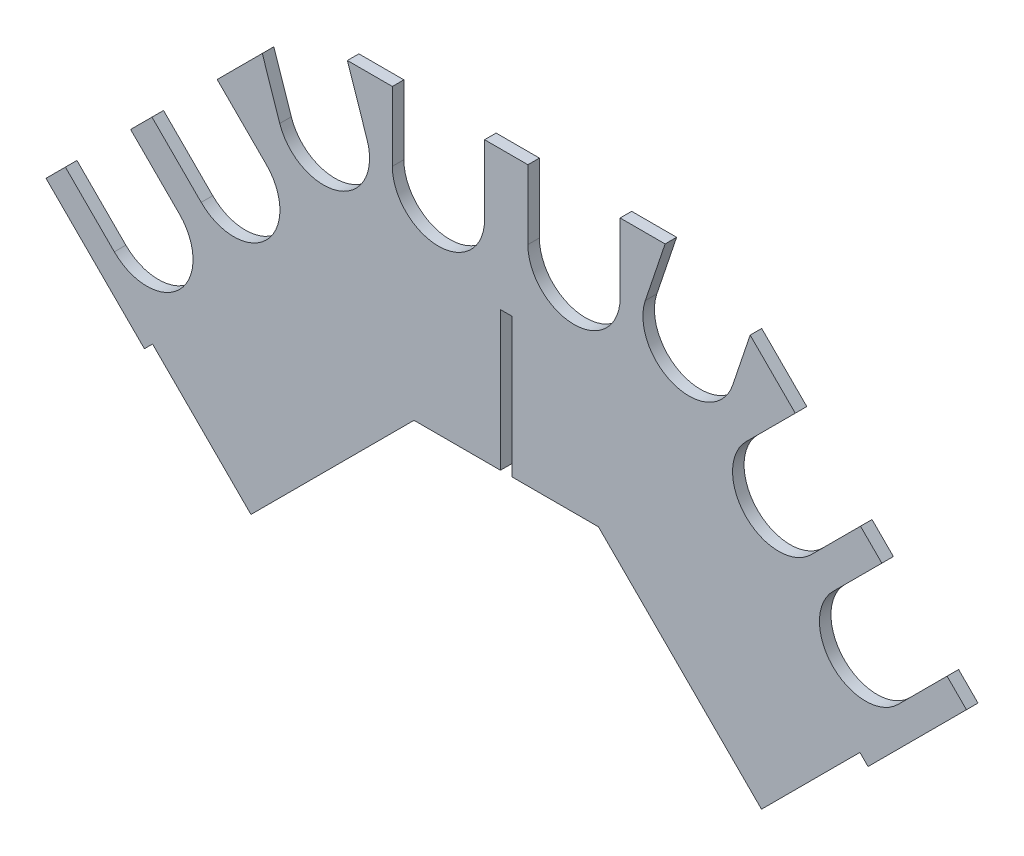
ISO-10303-21;
HEADER;
FILE_DESCRIPTION(('STEP AP214'),'2;1');
FILE_NAME('part.step','',(''),(''),'','','');
FILE_SCHEMA(('AUTOMOTIVE_DESIGN { 1 0 10303 214 1 1 1 1 }'));
ENDSEC;
DATA;
#1=APPLICATION_CONTEXT('core data for automotive mechanical design processes');
#2=APPLICATION_PROTOCOL_DEFINITION('international standard','automotive_design',2000,#1);
#3=PRODUCT_CONTEXT('',#1,'mechanical');
#4=PRODUCT('Part','Part','',(#3));
#5=PRODUCT_RELATED_PRODUCT_CATEGORY('part','',(#4));
#6=PRODUCT_DEFINITION_FORMATION('','',#4);
#7=PRODUCT_DEFINITION_CONTEXT('part definition',#1,'design');
#8=PRODUCT_DEFINITION('design','',#6,#7);
#9=PRODUCT_DEFINITION_SHAPE('','',#8);
#10=(LENGTH_UNIT() NAMED_UNIT(*) SI_UNIT(.MILLI.,.METRE.));
#11=(NAMED_UNIT(*) PLANE_ANGLE_UNIT() SI_UNIT($,.RADIAN.));
#12=(NAMED_UNIT(*) SI_UNIT($,.STERADIAN.) SOLID_ANGLE_UNIT());
#13=UNCERTAINTY_MEASURE_WITH_UNIT(LENGTH_MEASURE(1.E-05),#10,'distance_accuracy_value','');
#14=(GEOMETRIC_REPRESENTATION_CONTEXT(3) GLOBAL_UNCERTAINTY_ASSIGNED_CONTEXT((#13)) GLOBAL_UNIT_ASSIGNED_CONTEXT((#10,
#11,#12)) REPRESENTATION_CONTEXT('',''));
#15=CARTESIAN_POINT('',(0.,0.,0.));
#16=DIRECTION('',(0.,0.,1.));
#17=DIRECTION('',(1.,0.,0.));
#18=AXIS2_PLACEMENT_3D('',#15,#16,#17);
#19=CARTESIAN_POINT('',(506.987939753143,506.987939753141,12.7));
#20=DIRECTION('',(-0.707106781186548,-0.707106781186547,0.));
#21=DIRECTION('',(0.707106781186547,-0.707106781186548,0.));
#22=AXIS2_PLACEMENT_3D('',#19,#20,#21);
#23=PLANE('',#22);
#24=DIRECTION('',(-0.707106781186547,0.707106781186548,0.));
#25=VECTOR('',#24,1.);
#26=CARTESIAN_POINT('',(506.987939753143,506.987939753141,0.));
#27=LINE('',#26,#25);
#28=CARTESIAN_POINT('',(506.987939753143,506.987939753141,0.));
#29=VERTEX_POINT('',#28);
#30=CARTESIAN_POINT('',(485.626787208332,528.349092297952,0.));
#31=VERTEX_POINT('',#30);
#32=EDGE_CURVE('E336',#29,#31,#27,.T.);
#33=ORIENTED_EDGE('',*,*,#32,.T.);
#34=DIRECTION('',(0.,0.,1.));
#35=VECTOR('',#34,1.);
#36=CARTESIAN_POINT('',(485.626787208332,528.349092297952,-0.000999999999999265));
#37=LINE('',#36,#35);
#38=CARTESIAN_POINT('',(485.626787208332,528.349092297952,12.7));
#39=VERTEX_POINT('',#38);
#40=EDGE_CURVE('E322',#31,#39,#37,.T.);
#41=ORIENTED_EDGE('',*,*,#40,.T.);
#42=DIRECTION('',(-0.707106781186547,0.707106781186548,0.));
#43=VECTOR('',#42,1.);
#44=CARTESIAN_POINT('',(506.987939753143,506.987939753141,12.7));
#45=LINE('',#44,#43);
#46=CARTESIAN_POINT('',(506.987939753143,506.987939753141,12.7));
#47=VERTEX_POINT('',#46);
#48=EDGE_CURVE('E399',#47,#39,#45,.T.);
#49=ORIENTED_EDGE('',*,*,#48,.F.);
#50=DIRECTION('',(0.,0.,-1.));
#51=VECTOR('',#50,1.);
#52=CARTESIAN_POINT('',(506.987939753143,506.987939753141,12.7));
#53=LINE('',#52,#51);
#54=EDGE_CURVE('E11',#47,#29,#53,.T.);
#55=ORIENTED_EDGE('',*,*,#54,.T.);
#56=EDGE_LOOP('',(#33,#41,#49,#55));
#57=FACE_BOUND('',#56,.T.);
#58=ADVANCED_FACE('F31',(#57),#23,.F.);
#59=CARTESIAN_POINT('',(395.82422599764,510.388580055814,12.7));
#60=DIRECTION('',(0.,0.,-1.));
#61=DIRECTION('',(-1.,0.,0.));
#62=AXIS2_PLACEMENT_3D('',#59,#60,#61);
#63=CYLINDRICAL_SURFACE('',#62,50.8);
#64=CARTESIAN_POINT('',(395.82422599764,510.388580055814,12.7));
#65=DIRECTION('',(0.,0.,1.));
#66=DIRECTION('',(1.,0.,0.));
#67=AXIS2_PLACEMENT_3D('',#64,#65,#66);
#68=CIRCLE('',#67,50.8);
#69=CARTESIAN_POINT('',(359.903201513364,546.309604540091,12.7));
#70=VERTEX_POINT('',#69);
#71=CARTESIAN_POINT('',(431.745250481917,474.467555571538,12.7));
#72=VERTEX_POINT('',#71);
#73=EDGE_CURVE('E358',#70,#72,#68,.T.);
#74=ORIENTED_EDGE('',*,*,#73,.T.);
#75=DIRECTION('',(0.,0.,1.));
#76=VECTOR('',#75,1.);
#77=CARTESIAN_POINT('',(431.745250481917,474.467555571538,-0.000999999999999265));
#78=LINE('',#77,#76);
#79=CARTESIAN_POINT('',(431.745250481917,474.467555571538,0.));
#80=VERTEX_POINT('',#79);
#81=EDGE_CURVE('E330',#80,#72,#78,.T.);
#82=ORIENTED_EDGE('',*,*,#81,.F.);
#83=CARTESIAN_POINT('',(395.82422599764,510.388580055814,0.));
#84=DIRECTION('',(0.,0.,1.));
#85=DIRECTION('',(1.,0.,0.));
#86=AXIS2_PLACEMENT_3D('',#83,#84,#85);
#87=CIRCLE('',#86,50.8);
#88=CARTESIAN_POINT('',(359.903201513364,546.309604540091,0.));
#89=VERTEX_POINT('',#88);
#90=EDGE_CURVE('E339',#89,#80,#87,.T.);
#91=ORIENTED_EDGE('',*,*,#90,.F.);
#92=DIRECTION('',(0.,0.,1.));
#93=VECTOR('',#92,1.);
#94=CARTESIAN_POINT('',(359.903201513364,546.309604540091,-0.000999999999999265));
#95=LINE('',#94,#93);
#96=EDGE_CURVE('E594',#89,#70,#95,.T.);
#97=ORIENTED_EDGE('',*,*,#96,.T.);
#98=EDGE_LOOP('',(#74,#82,#91,#97));
#99=FACE_BOUND('',#98,.T.);
#100=ADVANCED_FACE('F602',(#99),#63,.F.);
#101=CARTESIAN_POINT('',(-506.987939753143,506.987939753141,12.7));
#102=DIRECTION('',(0.707106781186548,-0.707106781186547,0.));
#103=DIRECTION('',(0.707106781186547,0.707106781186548,0.));
#104=AXIS2_PLACEMENT_3D('',#101,#102,#103);
#105=PLANE('',#104);
#106=DIRECTION('',(-0.707106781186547,-0.707106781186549,0.));
#107=VECTOR('',#106,1.);
#108=CARTESIAN_POINT('',(-506.987939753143,506.987939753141,0.));
#109=LINE('',#108,#107);
#110=CARTESIAN_POINT('',(-390.244610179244,623.731269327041,0.));
#111=VERTEX_POINT('',#110);
#112=CARTESIAN_POINT('',(-413.784738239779,600.191141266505,0.));
#113=VERTEX_POINT('',#112);
#114=EDGE_CURVE('E750',#111,#113,#109,.T.);
#115=ORIENTED_EDGE('',*,*,#114,.T.);
#116=DIRECTION('',(0.,0.,1.));
#117=VECTOR('',#116,1.);
#118=CARTESIAN_POINT('',(-413.784738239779,600.191141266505,-0.000999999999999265));
#119=LINE('',#118,#117);
#120=CARTESIAN_POINT('',(-413.784738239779,600.191141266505,12.7));
#121=VERTEX_POINT('',#120);
#122=EDGE_CURVE('E574',#113,#121,#119,.T.);
#123=ORIENTED_EDGE('',*,*,#122,.T.);
#124=DIRECTION('',(-0.707106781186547,-0.707106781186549,0.));
#125=VECTOR('',#124,1.);
#126=CARTESIAN_POINT('',(-506.987939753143,506.987939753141,12.7));
#127=LINE('',#126,#125);
#128=CARTESIAN_POINT('',(-390.244610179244,623.731269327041,12.7));
#129=VERTEX_POINT('',#128);
#130=EDGE_CURVE('E392',#129,#121,#127,.T.);
#131=ORIENTED_EDGE('',*,*,#130,.F.);
#132=DIRECTION('',(0.,0.,1.));
#133=VECTOR('',#132,1.);
#134=CARTESIAN_POINT('',(-390.244610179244,623.731269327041,-0.000999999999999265));
#135=LINE('',#134,#133);
#136=EDGE_CURVE('E555',#111,#129,#135,.T.);
#137=ORIENTED_EDGE('',*,*,#136,.F.);
#138=EDGE_LOOP('',(#115,#123,#131,#137));
#139=FACE_BOUND('',#138,.T.);
#140=ADVANCED_FACE('F676',(#139),#105,.F.);
#141=CARTESIAN_POINT('',(-395.82422599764,510.388580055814,12.7));
#142=DIRECTION('',(0.,0.,-1.));
#143=DIRECTION('',(-1.,0.,0.));
#144=AXIS2_PLACEMENT_3D('',#141,#142,#143);
#145=CYLINDRICAL_SURFACE('',#144,50.7999999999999);
#146=CARTESIAN_POINT('',(-395.82422599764,510.388580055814,12.7));
#147=DIRECTION('',(0.,0.,1.));
#148=DIRECTION('',(1.,0.,0.));
#149=AXIS2_PLACEMENT_3D('',#146,#147,#148);
#150=CIRCLE('',#149,50.7999999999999);
#151=CARTESIAN_POINT('',(-431.745250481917,474.467555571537,12.7));
#152=VERTEX_POINT('',#151);
#153=CARTESIAN_POINT('',(-359.903201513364,546.30960454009,12.7));
#154=VERTEX_POINT('',#153);
#155=EDGE_CURVE('E412',#152,#154,#150,.T.);
#156=ORIENTED_EDGE('',*,*,#155,.T.);
#157=DIRECTION('',(0.,0.,1.));
#158=VECTOR('',#157,1.);
#159=CARTESIAN_POINT('',(-359.903201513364,546.30960454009,-0.000999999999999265));
#160=LINE('',#159,#158);
#161=CARTESIAN_POINT('',(-359.903201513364,546.30960454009,0.));
#162=VERTEX_POINT('',#161);
#163=EDGE_CURVE('E581',#162,#154,#160,.T.);
#164=ORIENTED_EDGE('',*,*,#163,.F.);
#165=CARTESIAN_POINT('',(-395.82422599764,510.388580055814,0.));
#166=DIRECTION('',(0.,0.,1.));
#167=DIRECTION('',(1.,0.,0.));
#168=AXIS2_PLACEMENT_3D('',#165,#166,#167);
#169=CIRCLE('',#168,50.7999999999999);
#170=CARTESIAN_POINT('',(-431.745250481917,474.467555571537,0.));
#171=VERTEX_POINT('',#170);
#172=EDGE_CURVE('E415',#171,#162,#169,.T.);
#173=ORIENTED_EDGE('',*,*,#172,.F.);
#174=DIRECTION('',(0.,0.,1.));
#175=VECTOR('',#174,1.);
#176=CARTESIAN_POINT('',(-431.745250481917,474.467555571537,-0.000999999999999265));
#177=LINE('',#176,#175);
#178=EDGE_CURVE('E577',#171,#152,#177,.T.);
#179=ORIENTED_EDGE('',*,*,#178,.T.);
#180=EDGE_LOOP('',(#156,#164,#173,#179));
#181=FACE_BOUND('',#180,.T.);
#182=ADVANCED_FACE('F674',(#181),#145,.F.);
#183=CARTESIAN_POINT('',(-268.713748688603,745.262130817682,0.));
#184=VERTEX_POINT('',#183);
#185=CARTESIAN_POINT('',(-318.40256121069,695.573318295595,0.));
#186=VERTEX_POINT('',#185);
#187=EDGE_CURVE('E747',#184,#186,#109,.T.);
#188=ORIENTED_EDGE('',*,*,#187,.T.);
#189=DIRECTION('',(0.,0.,1.));
#190=VECTOR('',#189,1.);
#191=CARTESIAN_POINT('',(-318.40256121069,695.573318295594,-0.000999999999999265));
#192=LINE('',#191,#190);
#193=CARTESIAN_POINT('',(-318.40256121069,695.573318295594,12.7));
#194=VERTEX_POINT('',#193);
#195=EDGE_CURVE('E554',#186,#194,#192,.T.);
#196=ORIENTED_EDGE('',*,*,#195,.T.);
#197=CARTESIAN_POINT('',(-268.713748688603,745.262130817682,12.7));
#198=VERTEX_POINT('',#197);
#199=EDGE_CURVE('E389',#198,#194,#127,.T.);
#200=ORIENTED_EDGE('',*,*,#199,.F.);
#201=DIRECTION('',(0.,0.,1.));
#202=VECTOR('',#201,1.);
#203=CARTESIAN_POINT('',(-268.713748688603,745.262130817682,-0.000999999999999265));
#204=LINE('',#203,#202);
#205=EDGE_CURVE('E532',#184,#198,#204,.T.);
#206=ORIENTED_EDGE('',*,*,#205,.F.);
#207=EDGE_LOOP('',(#188,#196,#200,#206));
#208=FACE_BOUND('',#207,.T.);
#209=ADVANCED_FACE('F672',(#208),#105,.F.);
#210=CARTESIAN_POINT('',(-300.122945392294,605.451653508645,12.7));
#211=DIRECTION('',(0.,0.,-1.));
#212=DIRECTION('',(-1.,0.,0.));
#213=AXIS2_PLACEMENT_3D('',#210,#211,#212);
#214=CYLINDRICAL_SURFACE('',#213,50.8);
#215=CARTESIAN_POINT('',(-300.122945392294,605.451653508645,12.7));
#216=DIRECTION('',(0.,0.,1.));
#217=DIRECTION('',(1.,0.,0.));
#218=AXIS2_PLACEMENT_3D('',#215,#216,#217);
#219=CIRCLE('',#218,50.8);
#220=CARTESIAN_POINT('',(-336.043969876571,569.530629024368,12.7));
#221=VERTEX_POINT('',#220);
#222=CARTESIAN_POINT('',(-264.201920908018,641.372677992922,12.7));
#223=VERTEX_POINT('',#222);
#224=EDGE_CURVE('E418',#221,#223,#219,.T.);
#225=ORIENTED_EDGE('',*,*,#224,.T.);
#226=DIRECTION('',(0.,0.,1.));
#227=VECTOR('',#226,1.);
#228=CARTESIAN_POINT('',(-264.201920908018,641.372677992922,-0.000999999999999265));
#229=LINE('',#228,#227);
#230=CARTESIAN_POINT('',(-264.201920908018,641.372677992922,0.));
#231=VERTEX_POINT('',#230);
#232=EDGE_CURVE('E561',#231,#223,#229,.T.);
#233=ORIENTED_EDGE('',*,*,#232,.F.);
#234=CARTESIAN_POINT('',(-300.122945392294,605.451653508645,0.));
#235=DIRECTION('',(0.,0.,1.));
#236=DIRECTION('',(1.,0.,0.));
#237=AXIS2_PLACEMENT_3D('',#234,#235,#236);
#238=CIRCLE('',#237,50.8);
#239=CARTESIAN_POINT('',(-336.043969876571,569.530629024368,0.));
#240=VERTEX_POINT('',#239);
#241=EDGE_CURVE('E421',#240,#231,#238,.T.);
#242=ORIENTED_EDGE('',*,*,#241,.F.);
#243=DIRECTION('',(0.,0.,1.));
#244=VECTOR('',#243,1.);
#245=CARTESIAN_POINT('',(-336.043969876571,569.530629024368,-0.000999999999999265));
#246=LINE('',#245,#244);
#247=EDGE_CURVE('E557',#240,#221,#246,.T.);
#248=ORIENTED_EDGE('',*,*,#247,.T.);
#249=EDGE_LOOP('',(#225,#233,#242,#248));
#250=FACE_BOUND('',#249,.T.);
#251=ADVANCED_FACE('F668',(#250),#214,.F.);
#252=CARTESIAN_POINT('',(-201.340128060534,704.234470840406,12.7));
#253=DIRECTION('',(0.,0.,-1.));
#254=DIRECTION('',(-1.,0.,0.));
#255=AXIS2_PLACEMENT_3D('',#252,#253,#254);
#256=CYLINDRICAL_SURFACE('',#255,50.8);
#257=CARTESIAN_POINT('',(-201.340128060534,704.234470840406,12.7));
#258=DIRECTION('',(0.,0.,1.));
#259=DIRECTION('',(1.,0.,0.));
#260=AXIS2_PLACEMENT_3D('',#257,#258,#259);
#261=CIRCLE('',#260,50.8);
#262=CARTESIAN_POINT('',(-249.495229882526,688.056517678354,12.7));
#263=VERTEX_POINT('',#262);
#264=CARTESIAN_POINT('',(-153.185026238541,720.412424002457,12.7));
#265=VERTEX_POINT('',#264);
#266=EDGE_CURVE('E424',#263,#265,#261,.T.);
#267=ORIENTED_EDGE('',*,*,#266,.T.);
#268=DIRECTION('',(0.,0.,1.));
#269=VECTOR('',#268,1.);
#270=CARTESIAN_POINT('',(-153.185026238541,720.412424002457,-0.000999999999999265));
#271=LINE('',#270,#269);
#272=CARTESIAN_POINT('',(-153.185026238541,720.412424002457,0.));
#273=VERTEX_POINT('',#272);
#274=EDGE_CURVE('E538',#273,#265,#271,.T.);
#275=ORIENTED_EDGE('',*,*,#274,.F.);
#276=CARTESIAN_POINT('',(-201.340128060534,704.234470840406,0.));
#277=DIRECTION('',(0.,0.,1.));
#278=DIRECTION('',(1.,0.,0.));
#279=AXIS2_PLACEMENT_3D('',#276,#277,#278);
#280=CIRCLE('',#279,50.8);
#281=CARTESIAN_POINT('',(-249.495229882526,688.056517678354,0.));
#282=VERTEX_POINT('',#281);
#283=EDGE_CURVE('E427',#282,#273,#280,.T.);
#284=ORIENTED_EDGE('',*,*,#283,.F.);
#285=DIRECTION('',(0.,0.,1.));
#286=VECTOR('',#285,1.);
#287=CARTESIAN_POINT('',(-249.495229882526,688.056517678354,-0.000999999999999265));
#288=LINE('',#287,#286);
#289=EDGE_CURVE('E534',#282,#263,#288,.T.);
#290=ORIENTED_EDGE('',*,*,#289,.T.);
#291=EDGE_LOOP('',(#267,#275,#284,#290));
#292=FACE_BOUND('',#291,.T.);
#293=ADVANCED_FACE('F665',(#292),#256,.F.);
#294=CARTESIAN_POINT('',(-228.6,785.375879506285,12.7));
#295=DIRECTION('',(0.,-1.,0.));
#296=DIRECTION('',(1.,0.,0.));
#297=AXIS2_PLACEMENT_3D('',#294,#295,#296);
#298=PLANE('',#297);
#299=DIRECTION('',(-1.,0.,0.));
#300=VECTOR('',#299,1.);
#301=CARTESIAN_POINT('',(-228.6,785.375879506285,0.));
#302=LINE('',#301,#300);
#303=CARTESIAN_POINT('',(23.8592316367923,785.375879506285,0.));
#304=VERTEX_POINT('',#303);
#305=CARTESIAN_POINT('',(-23.8592316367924,785.375879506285,0.));
#306=VERTEX_POINT('',#305);
#307=EDGE_CURVE('E348',#304,#306,#302,.T.);
#308=ORIENTED_EDGE('',*,*,#307,.T.);
#309=DIRECTION('',(0.,0.,1.));
#310=VECTOR('',#309,1.);
#311=CARTESIAN_POINT('',(-23.8592316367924,785.375879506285,-0.000999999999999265));
#312=LINE('',#311,#310);
#313=CARTESIAN_POINT('',(-23.8592316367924,785.375879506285,12.7));
#314=VERTEX_POINT('',#313);
#315=EDGE_CURVE('E514',#306,#314,#312,.T.);
#316=ORIENTED_EDGE('',*,*,#315,.T.);
#317=DIRECTION('',(-1.,0.,0.));
#318=VECTOR('',#317,1.);
#319=CARTESIAN_POINT('',(-228.6,785.375879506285,12.7));
#320=LINE('',#319,#318);
#321=CARTESIAN_POINT('',(23.8592316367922,785.375879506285,12.7));
#322=VERTEX_POINT('',#321);
#323=EDGE_CURVE('E397',#322,#314,#320,.T.);
#324=ORIENTED_EDGE('',*,*,#323,.F.);
#325=DIRECTION('',(0.,0.,1.));
#326=VECTOR('',#325,1.);
#327=CARTESIAN_POINT('',(23.8592316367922,785.375879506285,-0.000999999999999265));
#328=LINE('',#327,#326);
#329=EDGE_CURVE('E495',#304,#322,#328,.T.);
#330=ORIENTED_EDGE('',*,*,#329,.F.);
#331=EDGE_LOOP('',(#308,#316,#324,#330));
#332=FACE_BOUND('',#331,.T.);
#333=ADVANCED_FACE('F642',(#332),#298,.F.);
#334=CARTESIAN_POINT('',(-74.6592316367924,709.175879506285,12.7));
#335=DIRECTION('',(0.,0.,-1.));
#336=DIRECTION('',(-1.,0.,0.));
#337=AXIS2_PLACEMENT_3D('',#334,#335,#336);
#338=CYLINDRICAL_SURFACE('',#337,50.8);
#339=CARTESIAN_POINT('',(-74.6592316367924,709.175879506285,12.7));
#340=DIRECTION('',(0.,0.,1.));
#341=DIRECTION('',(1.,0.,0.));
#342=AXIS2_PLACEMENT_3D('',#339,#340,#341);
#343=CIRCLE('',#342,50.8);
#344=CARTESIAN_POINT('',(-125.459231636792,709.175879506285,12.7));
#345=VERTEX_POINT('',#344);
#346=CARTESIAN_POINT('',(-23.8592316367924,709.175879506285,12.7));
#347=VERTEX_POINT('',#346);
#348=EDGE_CURVE('E430',#345,#347,#343,.T.);
#349=ORIENTED_EDGE('',*,*,#348,.T.);
#350=DIRECTION('',(0.,0.,1.));
#351=VECTOR('',#350,1.);
#352=CARTESIAN_POINT('',(-23.8592316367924,709.175879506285,-0.000999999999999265));
#353=LINE('',#352,#351);
#354=CARTESIAN_POINT('',(-23.8592316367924,709.175879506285,0.));
#355=VERTEX_POINT('',#354);
#356=EDGE_CURVE('E521',#355,#347,#353,.T.);
#357=ORIENTED_EDGE('',*,*,#356,.F.);
#358=CARTESIAN_POINT('',(-74.6592316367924,709.175879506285,0.));
#359=DIRECTION('',(0.,0.,1.));
#360=DIRECTION('',(1.,0.,0.));
#361=AXIS2_PLACEMENT_3D('',#358,#359,#360);
#362=CIRCLE('',#361,50.8);
#363=CARTESIAN_POINT('',(-125.459231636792,709.175879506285,0.));
#364=VERTEX_POINT('',#363);
#365=EDGE_CURVE('E433',#364,#355,#362,.T.);
#366=ORIENTED_EDGE('',*,*,#365,.F.);
#367=DIRECTION('',(0.,0.,1.));
#368=VECTOR('',#367,1.);
#369=CARTESIAN_POINT('',(-125.459231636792,709.175879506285,-0.000999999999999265));
#370=LINE('',#369,#368);
#371=EDGE_CURVE('E517',#364,#345,#370,.T.);
#372=ORIENTED_EDGE('',*,*,#371,.T.);
#373=EDGE_LOOP('',(#349,#357,#366,#372));
#374=FACE_BOUND('',#373,.T.);
#375=ADVANCED_FACE('F657',(#374),#338,.F.);
#376=CARTESIAN_POINT('',(175.009831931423,785.375879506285,0.));
#377=VERTEX_POINT('',#376);
#378=CARTESIAN_POINT('',(125.459231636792,785.375879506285,0.));
#379=VERTEX_POINT('',#378);
#380=EDGE_CURVE('E350',#377,#379,#302,.T.);
#381=ORIENTED_EDGE('',*,*,#380,.T.);
#382=DIRECTION('',(0.,0.,1.));
#383=VECTOR('',#382,1.);
#384=CARTESIAN_POINT('',(125.459231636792,785.375879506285,-0.000999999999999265));
#385=LINE('',#384,#383);
#386=CARTESIAN_POINT('',(125.459231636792,785.375879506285,12.7));
#387=VERTEX_POINT('',#386);
#388=EDGE_CURVE('E494',#379,#387,#385,.T.);
#389=ORIENTED_EDGE('',*,*,#388,.T.);
#390=CARTESIAN_POINT('',(175.009831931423,785.375879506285,12.7));
#391=VERTEX_POINT('',#390);
#392=EDGE_CURVE('E394',#391,#387,#320,.T.);
#393=ORIENTED_EDGE('',*,*,#392,.F.);
#394=DIRECTION('',(0.,0.,1.));
#395=VECTOR('',#394,1.);
#396=CARTESIAN_POINT('',(175.009831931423,785.375879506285,-0.000999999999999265));
#397=LINE('',#396,#395);
#398=EDGE_CURVE('E459',#377,#391,#397,.T.);
#399=ORIENTED_EDGE('',*,*,#398,.F.);
#400=EDGE_LOOP('',(#381,#389,#393,#399));
#401=FACE_BOUND('',#400,.T.);
#402=ADVANCED_FACE('F643',(#401),#298,.F.);
#403=CARTESIAN_POINT('',(74.6592316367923,709.175879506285,12.7));
#404=DIRECTION('',(0.,0.,-1.));
#405=DIRECTION('',(-1.,0.,0.));
#406=AXIS2_PLACEMENT_3D('',#403,#404,#405);
#407=CYLINDRICAL_SURFACE('',#406,50.8);
#408=CARTESIAN_POINT('',(74.6592316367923,709.175879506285,12.7));
#409=DIRECTION('',(0.,0.,1.));
#410=DIRECTION('',(1.,0.,0.));
#411=AXIS2_PLACEMENT_3D('',#408,#409,#410);
#412=CIRCLE('',#411,50.8);
#413=CARTESIAN_POINT('',(23.8592316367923,709.175879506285,12.7));
#414=VERTEX_POINT('',#413);
#415=CARTESIAN_POINT('',(125.459231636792,709.175879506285,12.7));
#416=VERTEX_POINT('',#415);
#417=EDGE_CURVE('E436',#414,#416,#412,.T.);
#418=ORIENTED_EDGE('',*,*,#417,.T.);
#419=DIRECTION('',(0.,0.,1.));
#420=VECTOR('',#419,1.);
#421=CARTESIAN_POINT('',(125.459231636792,709.175879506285,-0.000999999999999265));
#422=LINE('',#421,#420);
#423=CARTESIAN_POINT('',(125.459231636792,709.175879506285,0.));
#424=VERTEX_POINT('',#423);
#425=EDGE_CURVE('E501',#424,#416,#422,.T.);
#426=ORIENTED_EDGE('',*,*,#425,.F.);
#427=CARTESIAN_POINT('',(74.6592316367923,709.175879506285,0.));
#428=DIRECTION('',(0.,0.,1.));
#429=DIRECTION('',(1.,0.,0.));
#430=AXIS2_PLACEMENT_3D('',#427,#428,#429);
#431=CIRCLE('',#430,50.8);
#432=CARTESIAN_POINT('',(23.8592316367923,709.175879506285,0.));
#433=VERTEX_POINT('',#432);
#434=EDGE_CURVE('E439',#433,#424,#431,.T.);
#435=ORIENTED_EDGE('',*,*,#434,.F.);
#436=DIRECTION('',(0.,0.,1.));
#437=VECTOR('',#436,1.);
#438=CARTESIAN_POINT('',(23.8592316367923,709.175879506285,-0.000999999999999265));
#439=LINE('',#438,#437);
#440=EDGE_CURVE('E497',#433,#414,#439,.T.);
#441=ORIENTED_EDGE('',*,*,#440,.T.);
#442=EDGE_LOOP('',(#418,#426,#435,#441));
#443=FACE_BOUND('',#442,.T.);
#444=ADVANCED_FACE('F646',(#443),#407,.F.);
#445=CARTESIAN_POINT('',(413.784738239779,600.191141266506,12.7));
#446=VERTEX_POINT('',#445);
#447=CARTESIAN_POINT('',(390.244610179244,623.731269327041,12.7));
#448=VERTEX_POINT('',#447);
#449=EDGE_CURVE('E401',#446,#448,#45,.T.);
#450=ORIENTED_EDGE('',*,*,#449,.F.);
#451=DIRECTION('',(0.,0.,1.));
#452=VECTOR('',#451,1.);
#453=CARTESIAN_POINT('',(413.784738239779,600.191141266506,-0.000999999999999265));
#454=LINE('',#453,#452);
#455=CARTESIAN_POINT('',(413.784738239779,600.191141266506,0.));
#456=VERTEX_POINT('',#455);
#457=EDGE_CURVE('E592',#456,#446,#454,.T.);
#458=ORIENTED_EDGE('',*,*,#457,.F.);
#459=CARTESIAN_POINT('',(390.244610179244,623.731269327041,0.));
#460=VERTEX_POINT('',#459);
#461=EDGE_CURVE('E344',#456,#460,#27,.T.);
#462=ORIENTED_EDGE('',*,*,#461,.T.);
#463=DIRECTION('',(0.,0.,1.));
#464=VECTOR('',#463,1.);
#465=CARTESIAN_POINT('',(390.244610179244,623.731269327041,-0.000999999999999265));
#466=LINE('',#465,#464);
#467=EDGE_CURVE('E473',#460,#448,#466,.T.);
#468=ORIENTED_EDGE('',*,*,#467,.T.);
#469=EDGE_LOOP('',(#450,#458,#462,#468));
#470=FACE_BOUND('',#469,.T.);
#471=ADVANCED_FACE('F609',(#470),#23,.F.);
#472=CARTESIAN_POINT('',(300.122945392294,605.451653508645,12.7));
#473=DIRECTION('',(0.,0.,-1.));
#474=DIRECTION('',(-1.,0.,0.));
#475=AXIS2_PLACEMENT_3D('',#472,#473,#474);
#476=CYLINDRICAL_SURFACE('',#475,50.8);
#477=CARTESIAN_POINT('',(300.122945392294,605.451653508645,12.7));
#478=DIRECTION('',(0.,0.,1.));
#479=DIRECTION('',(1.,0.,0.));
#480=AXIS2_PLACEMENT_3D('',#477,#478,#479);
#481=CIRCLE('',#480,50.8);
#482=CARTESIAN_POINT('',(264.201920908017,641.372677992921,12.7));
#483=VERTEX_POINT('',#482);
#484=CARTESIAN_POINT('',(336.043969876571,569.530629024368,12.7));
#485=VERTEX_POINT('',#484);
#486=EDGE_CURVE('E407',#483,#485,#481,.T.);
#487=ORIENTED_EDGE('',*,*,#486,.T.);
#488=DIRECTION('',(0.,0.,1.));
#489=VECTOR('',#488,1.);
#490=CARTESIAN_POINT('',(336.043969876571,569.530629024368,-0.000999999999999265));
#491=LINE('',#490,#489);
#492=CARTESIAN_POINT('',(336.043969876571,569.530629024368,0.));
#493=VERTEX_POINT('',#492);
#494=EDGE_CURVE('E480',#493,#485,#491,.T.);
#495=ORIENTED_EDGE('',*,*,#494,.F.);
#496=CARTESIAN_POINT('',(300.122945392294,605.451653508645,0.));
#497=DIRECTION('',(0.,0.,1.));
#498=DIRECTION('',(1.,0.,0.));
#499=AXIS2_PLACEMENT_3D('',#496,#497,#498);
#500=CIRCLE('',#499,50.8);
#501=CARTESIAN_POINT('',(264.201920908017,641.372677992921,0.));
#502=VERTEX_POINT('',#501);
#503=EDGE_CURVE('E409',#502,#493,#500,.T.);
#504=ORIENTED_EDGE('',*,*,#503,.F.);
#505=DIRECTION('',(0.,0.,1.));
#506=VECTOR('',#505,1.);
#507=CARTESIAN_POINT('',(264.201920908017,641.372677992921,-0.000999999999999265));
#508=LINE('',#507,#506);
#509=EDGE_CURVE('E476',#502,#483,#508,.T.);
#510=ORIENTED_EDGE('',*,*,#509,.T.);
#511=EDGE_LOOP('',(#487,#495,#504,#510));
#512=FACE_BOUND('',#511,.T.);
#513=ADVANCED_FACE('F617',(#512),#476,.F.);
#514=CARTESIAN_POINT('',(290.185378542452,290.185378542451,12.7));
#515=DIRECTION('',(0.,0.,-1.));
#516=DIRECTION('',(-1.,0.,0.));
#517=AXIS2_PLACEMENT_3D('',#514,#515,#516);
#518=PLANE('',#517);
#519=ORIENTED_EDGE('',*,*,#48,.T.);
#520=DIRECTION('',(0.707106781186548,0.707106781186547,0.));
#521=VECTOR('',#520,1.);
#522=CARTESIAN_POINT('',(485.626787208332,528.349092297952,12.7));
#523=LINE('',#522,#521);
#524=EDGE_CURVE('E325',#72,#39,#523,.T.);
#525=ORIENTED_EDGE('',*,*,#524,.F.);
#526=ORIENTED_EDGE('',*,*,#73,.F.);
#527=DIRECTION('',(-0.707106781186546,-0.707106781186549,0.));
#528=VECTOR('',#527,1.);
#529=CARTESIAN_POINT('',(413.784738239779,600.191141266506,12.7));
#530=LINE('',#529,#528);
#531=EDGE_CURVE('E54',#446,#70,#530,.T.);
#532=ORIENTED_EDGE('',*,*,#531,.F.);
#533=ORIENTED_EDGE('',*,*,#449,.T.);
#534=DIRECTION('',(0.707106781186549,0.707106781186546,0.));
#535=VECTOR('',#534,1.);
#536=CARTESIAN_POINT('',(390.244610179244,623.731269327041,12.7));
#537=LINE('',#536,#535);
#538=EDGE_CURVE('E477',#485,#448,#537,.T.);
#539=ORIENTED_EDGE('',*,*,#538,.F.);
#540=ORIENTED_EDGE('',*,*,#486,.F.);
#541=DIRECTION('',(-0.707106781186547,-0.707106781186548,0.));
#542=VECTOR('',#541,1.);
#543=CARTESIAN_POINT('',(318.40256121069,695.573318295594,12.7));
#544=LINE('',#543,#542);
#545=CARTESIAN_POINT('',(318.40256121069,695.573318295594,12.7));
#546=VERTEX_POINT('',#545);
#547=EDGE_CURVE('E486',#546,#483,#544,.T.);
#548=ORIENTED_EDGE('',*,*,#547,.F.);
#549=CARTESIAN_POINT('',(268.713748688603,745.262130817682,12.7));
#550=VERTEX_POINT('',#549);
#551=EDGE_CURVE('E402',#546,#550,#45,.T.);
#552=ORIENTED_EDGE('',*,*,#551,.T.);
#553=DIRECTION('',(0.318463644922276,0.947935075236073,0.));
#554=VECTOR('',#553,1.);
#555=CARTESIAN_POINT('',(249.495229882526,688.056517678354,12.7));
#556=LINE('',#555,#554);
#557=CARTESIAN_POINT('',(249.495229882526,688.056517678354,12.7));
#558=VERTEX_POINT('',#557);
#559=EDGE_CURVE('E464',#558,#550,#556,.T.);
#560=ORIENTED_EDGE('',*,*,#559,.F.);
#561=CARTESIAN_POINT('',(201.340128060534,704.234470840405,12.7));
#562=DIRECTION('',(0.,0.,1.));
#563=DIRECTION('',(1.,0.,0.));
#564=AXIS2_PLACEMENT_3D('',#561,#562,#563);
#565=CIRCLE('',#564,50.8);
#566=CARTESIAN_POINT('',(153.185026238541,720.412424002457,12.7));
#567=VERTEX_POINT('',#566);
#568=EDGE_CURVE('E442',#567,#558,#565,.T.);
#569=ORIENTED_EDGE('',*,*,#568,.F.);
#570=DIRECTION('',(-0.318463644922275,-0.947935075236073,0.));
#571=VECTOR('',#570,1.);
#572=CARTESIAN_POINT('',(175.009831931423,785.375879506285,12.7));
#573=LINE('',#572,#571);
#574=EDGE_CURVE('E457',#391,#567,#573,.T.);
#575=ORIENTED_EDGE('',*,*,#574,.F.);
#576=ORIENTED_EDGE('',*,*,#392,.T.);
#577=DIRECTION('',(0.,1.,0.));
#578=VECTOR('',#577,1.);
#579=CARTESIAN_POINT('',(125.459231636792,785.375879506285,12.7));
#580=LINE('',#579,#578);
#581=EDGE_CURVE('E498',#416,#387,#580,.T.);
#582=ORIENTED_EDGE('',*,*,#581,.F.);
#583=ORIENTED_EDGE('',*,*,#417,.F.);
#584=DIRECTION('',(0.,-1.,0.));
#585=VECTOR('',#584,1.);
#586=CARTESIAN_POINT('',(23.8592316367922,785.375879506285,12.7));
#587=LINE('',#586,#585);
#588=EDGE_CURVE('E506',#322,#414,#587,.T.);
#589=ORIENTED_EDGE('',*,*,#588,.F.);
#590=ORIENTED_EDGE('',*,*,#323,.T.);
#591=DIRECTION('',(0.,1.,0.));
#592=VECTOR('',#591,1.);
#593=CARTESIAN_POINT('',(-23.8592316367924,785.375879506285,12.7));
#594=LINE('',#593,#592);
#595=EDGE_CURVE('E518',#347,#314,#594,.T.);
#596=ORIENTED_EDGE('',*,*,#595,.F.);
#597=ORIENTED_EDGE('',*,*,#348,.F.);
#598=DIRECTION('',(0.,-1.,0.));
#599=VECTOR('',#598,1.);
#600=CARTESIAN_POINT('',(-125.459231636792,785.375879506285,12.7));
#601=LINE('',#600,#599);
#602=CARTESIAN_POINT('',(-125.459231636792,785.375879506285,12.7));
#603=VERTEX_POINT('',#602);
#604=EDGE_CURVE('E526',#603,#345,#601,.T.);
#605=ORIENTED_EDGE('',*,*,#604,.F.);
#606=CARTESIAN_POINT('',(-175.009831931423,785.375879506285,12.7));
#607=VERTEX_POINT('',#606);
#608=EDGE_CURVE('E398',#603,#607,#320,.T.);
#609=ORIENTED_EDGE('',*,*,#608,.T.);
#610=DIRECTION('',(-0.318463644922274,0.947935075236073,0.));
#611=VECTOR('',#610,1.);
#612=CARTESIAN_POINT('',(-175.009831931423,785.375879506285,12.7));
#613=LINE('',#612,#611);
#614=EDGE_CURVE('E535',#265,#607,#613,.T.);
#615=ORIENTED_EDGE('',*,*,#614,.F.);
#616=ORIENTED_EDGE('',*,*,#266,.F.);
#617=DIRECTION('',(0.318463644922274,-0.947935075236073,0.));
#618=VECTOR('',#617,1.);
#619=CARTESIAN_POINT('',(-268.713748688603,745.262130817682,12.7));
#620=LINE('',#619,#618);
#621=EDGE_CURVE('E543',#198,#263,#620,.T.);
#622=ORIENTED_EDGE('',*,*,#621,.F.);
#623=ORIENTED_EDGE('',*,*,#199,.T.);
#624=DIRECTION('',(-0.707106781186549,0.707106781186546,0.));
#625=VECTOR('',#624,1.);
#626=CARTESIAN_POINT('',(-318.40256121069,695.573318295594,12.7));
#627=LINE('',#626,#625);
#628=EDGE_CURVE('E558',#223,#194,#627,.T.);
#629=ORIENTED_EDGE('',*,*,#628,.F.);
#630=ORIENTED_EDGE('',*,*,#224,.F.);
#631=DIRECTION('',(0.707106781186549,-0.707106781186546,0.));
#632=VECTOR('',#631,1.);
#633=CARTESIAN_POINT('',(-390.244610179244,623.731269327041,12.7));
#634=LINE('',#633,#632);
#635=EDGE_CURVE('E566',#129,#221,#634,.T.);
#636=ORIENTED_EDGE('',*,*,#635,.F.);
#637=ORIENTED_EDGE('',*,*,#130,.T.);
#638=DIRECTION('',(-0.707106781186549,0.707106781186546,0.));
#639=VECTOR('',#638,1.);
#640=CARTESIAN_POINT('',(-413.784738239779,600.191141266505,12.7));
#641=LINE('',#640,#639);
#642=EDGE_CURVE('E578',#154,#121,#641,.T.);
#643=ORIENTED_EDGE('',*,*,#642,.F.);
#644=ORIENTED_EDGE('',*,*,#155,.F.);
#645=DIRECTION('',(0.707106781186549,-0.707106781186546,0.));
#646=VECTOR('',#645,1.);
#647=CARTESIAN_POINT('',(-485.626787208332,528.349092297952,12.7));
#648=LINE('',#647,#646);
#649=CARTESIAN_POINT('',(-485.626787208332,528.349092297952,12.7));
#650=VERTEX_POINT('',#649);
#651=EDGE_CURVE('E586',#650,#152,#648,.T.);
#652=ORIENTED_EDGE('',*,*,#651,.F.);
#653=CARTESIAN_POINT('',(-506.987939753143,506.987939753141,12.7));
#654=VERTEX_POINT('',#653);
#655=EDGE_CURVE('E393',#650,#654,#127,.T.);
#656=ORIENTED_EDGE('',*,*,#655,.T.);
#657=DIRECTION('',(0.707106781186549,-0.707106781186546,0.));
#658=VECTOR('',#657,1.);
#659=CARTESIAN_POINT('',(-398.586659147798,398.586659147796,12.7));
#660=LINE('',#659,#658);
#661=CARTESIAN_POINT('',(-398.586659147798,398.586659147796,12.7));
#662=VERTEX_POINT('',#661);
#663=EDGE_CURVE('E387',#654,#662,#660,.T.);
#664=ORIENTED_EDGE('',*,*,#663,.T.);
#665=DIRECTION('',(0.707106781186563,0.707106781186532,0.));
#666=VECTOR('',#665,1.);
#667=CARTESIAN_POINT('',(-389.606403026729,407.566915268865,12.7));
#668=LINE('',#667,#666);
#669=CARTESIAN_POINT('',(-389.606403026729,407.566915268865,12.7));
#670=VERTEX_POINT('',#669);
#671=EDGE_CURVE('E385',#662,#670,#668,.T.);
#672=ORIENTED_EDGE('',*,*,#671,.T.);
#673=DIRECTION('',(0.707106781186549,-0.707106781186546,0.));
#674=VECTOR('',#673,1.);
#675=CARTESIAN_POINT('',(-389.606403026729,407.566915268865,12.7));
#676=LINE('',#675,#674);
#677=CARTESIAN_POINT('',(-281.205122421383,299.16563466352,12.7));
#678=VERTEX_POINT('',#677);
#679=EDGE_CURVE('E383',#670,#678,#676,.T.);
#680=ORIENTED_EDGE('',*,*,#679,.T.);
#681=DIRECTION('',(0.707106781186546,0.707106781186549,0.));
#682=VECTOR('',#681,1.);
#683=CARTESIAN_POINT('',(-101.6,478.770757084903,12.7));
#684=LINE('',#683,#682);
#685=CARTESIAN_POINT('',(-101.6,478.770757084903,12.7));
#686=VERTEX_POINT('',#685);
#687=EDGE_CURVE('E381',#678,#686,#684,.T.);
#688=ORIENTED_EDGE('',*,*,#687,.T.);
#689=DIRECTION('',(1.,0.,0.));
#690=VECTOR('',#689,1.);
#691=CARTESIAN_POINT('',(-101.6,478.770757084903,12.7));
#692=LINE('',#691,#690);
#693=CARTESIAN_POINT('',(-6.34999999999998,478.770757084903,12.7));
#694=VERTEX_POINT('',#693);
#695=EDGE_CURVE('E379',#686,#694,#692,.T.);
#696=ORIENTED_EDGE('',*,*,#695,.T.);
#697=DIRECTION('',(0.,1.,0.));
#698=VECTOR('',#697,1.);
#699=CARTESIAN_POINT('',(-6.35,632.073318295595,12.7));
#700=LINE('',#699,#698);
#701=CARTESIAN_POINT('',(-6.35,632.073318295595,12.7));
#702=VERTEX_POINT('',#701);
#703=EDGE_CURVE('E377',#694,#702,#700,.T.);
#704=ORIENTED_EDGE('',*,*,#703,.T.);
#705=DIRECTION('',(1.,0.,0.));
#706=VECTOR('',#705,1.);
#707=CARTESIAN_POINT('',(-6.35,632.073318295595,12.7));
#708=LINE('',#707,#706);
#709=CARTESIAN_POINT('',(6.35,632.073318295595,12.7));
#710=VERTEX_POINT('',#709);
#711=EDGE_CURVE('E375',#702,#710,#708,.T.);
#712=ORIENTED_EDGE('',*,*,#711,.T.);
#713=DIRECTION('',(0.,-1.,0.));
#714=VECTOR('',#713,1.);
#715=CARTESIAN_POINT('',(6.35,632.073318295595,12.7));
#716=LINE('',#715,#714);
#717=CARTESIAN_POINT('',(6.35000000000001,478.770757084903,12.7));
#718=VERTEX_POINT('',#717);
#719=EDGE_CURVE('E373',#710,#718,#716,.T.);
#720=ORIENTED_EDGE('',*,*,#719,.T.);
#721=DIRECTION('',(1.,0.,0.));
#722=VECTOR('',#721,1.);
#723=CARTESIAN_POINT('',(6.35000000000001,478.770757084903,12.7));
#724=LINE('',#723,#722);
#725=CARTESIAN_POINT('',(101.6,478.770757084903,12.7));
#726=VERTEX_POINT('',#725);
#727=EDGE_CURVE('E371',#718,#726,#724,.T.);
#728=ORIENTED_EDGE('',*,*,#727,.T.);
#729=DIRECTION('',(0.707106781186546,-0.707106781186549,0.));
#730=VECTOR('',#729,1.);
#731=CARTESIAN_POINT('',(101.6,478.770757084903,12.7));
#732=LINE('',#731,#730);
#733=CARTESIAN_POINT('',(281.205122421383,299.16563466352,12.7));
#734=VERTEX_POINT('',#733);
#735=EDGE_CURVE('E369',#726,#734,#732,.T.);
#736=ORIENTED_EDGE('',*,*,#735,.T.);
#737=DIRECTION('',(0.707106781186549,0.707106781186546,0.));
#738=VECTOR('',#737,1.);
#739=CARTESIAN_POINT('',(389.606403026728,407.566915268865,12.7));
#740=LINE('',#739,#738);
#741=CARTESIAN_POINT('',(389.606403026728,407.566915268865,12.7));
#742=VERTEX_POINT('',#741);
#743=EDGE_CURVE('E367',#734,#742,#740,.T.);
#744=ORIENTED_EDGE('',*,*,#743,.T.);
#745=DIRECTION('',(0.707106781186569,-0.707106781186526,0.));
#746=VECTOR('',#745,1.);
#747=CARTESIAN_POINT('',(389.606403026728,407.566915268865,12.7));
#748=LINE('',#747,#746);
#749=CARTESIAN_POINT('',(398.586659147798,398.586659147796,12.7));
#750=VERTEX_POINT('',#749);
#751=EDGE_CURVE('E364',#742,#750,#748,.T.);
#752=ORIENTED_EDGE('',*,*,#751,.T.);
#753=DIRECTION('',(0.707106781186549,0.707106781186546,0.));
#754=VECTOR('',#753,1.);
#755=CARTESIAN_POINT('',(398.586659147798,398.586659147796,12.7));
#756=LINE('',#755,#754);
#757=EDGE_CURVE('E403',#750,#47,#756,.T.);
#758=ORIENTED_EDGE('',*,*,#757,.T.);
#759=EDGE_LOOP('',(#519,#525,#526,#532,#533,#539,#540,#548,#552,#560,#569,#575,#576,#582,#583,
#589,#590,#596,#597,#605,#609,#615,#616,#622,#623,#629,#630,#636,#637,#643,#644,#652,#656,#664,
#672,#680,#688,#696,#704,#712,#720,#728,#736,#744,#752,#758));
#760=FACE_BOUND('',#759,.T.);
#761=ADVANCED_FACE('F601',(#760),#518,.F.);
#762=CARTESIAN_POINT('',(290.185378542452,290.185378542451,0.));
#763=DIRECTION('',(0.,0.,-1.));
#764=DIRECTION('',(-1.,0.,0.));
#765=AXIS2_PLACEMENT_3D('',#762,#763,#764);
#766=PLANE('',#765);
#767=DIRECTION('',(0.707106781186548,0.707106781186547,0.));
#768=VECTOR('',#767,1.);
#769=CARTESIAN_POINT('',(485.626787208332,528.349092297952,0.));
#770=LINE('',#769,#768);
#771=EDGE_CURVE('E46',#80,#31,#770,.T.);
#772=ORIENTED_EDGE('',*,*,#771,.T.);
#773=ORIENTED_EDGE('',*,*,#32,.F.);
#774=DIRECTION('',(0.707106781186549,0.707106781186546,0.));
#775=VECTOR('',#774,1.);
#776=CARTESIAN_POINT('',(398.586659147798,398.586659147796,0.));
#777=LINE('',#776,#775);
#778=CARTESIAN_POINT('',(398.586659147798,398.586659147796,0.));
#779=VERTEX_POINT('',#778);
#780=EDGE_CURVE('E352',#779,#29,#777,.T.);
#781=ORIENTED_EDGE('',*,*,#780,.F.);
#782=DIRECTION('',(0.707106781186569,-0.707106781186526,0.));
#783=VECTOR('',#782,1.);
#784=CARTESIAN_POINT('',(389.606403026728,407.566915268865,0.));
#785=LINE('',#784,#783);
#786=CARTESIAN_POINT('',(389.606403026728,407.566915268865,0.));
#787=VERTEX_POINT('',#786);
#788=EDGE_CURVE('E406',#787,#779,#785,.T.);
#789=ORIENTED_EDGE('',*,*,#788,.F.);
#790=DIRECTION('',(0.707106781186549,0.707106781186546,0.));
#791=VECTOR('',#790,1.);
#792=CARTESIAN_POINT('',(389.606403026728,407.566915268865,0.));
#793=LINE('',#792,#791);
#794=CARTESIAN_POINT('',(281.205122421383,299.16563466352,0.));
#795=VERTEX_POINT('',#794);
#796=EDGE_CURVE('E1124',#795,#787,#793,.T.);
#797=ORIENTED_EDGE('',*,*,#796,.F.);
#798=DIRECTION('',(0.707106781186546,-0.707106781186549,0.));
#799=VECTOR('',#798,1.);
#800=CARTESIAN_POINT('',(101.6,478.770757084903,0.));
#801=LINE('',#800,#799);
#802=CARTESIAN_POINT('',(101.6,478.770757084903,0.));
#803=VERTEX_POINT('',#802);
#804=EDGE_CURVE('E1126',#803,#795,#801,.T.);
#805=ORIENTED_EDGE('',*,*,#804,.F.);
#806=DIRECTION('',(1.,0.,0.));
#807=VECTOR('',#806,1.);
#808=CARTESIAN_POINT('',(6.35000000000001,478.770757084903,0.));
#809=LINE('',#808,#807);
#810=CARTESIAN_POINT('',(6.35000000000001,478.770757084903,0.));
#811=VERTEX_POINT('',#810);
#812=EDGE_CURVE('E1128',#811,#803,#809,.T.);
#813=ORIENTED_EDGE('',*,*,#812,.F.);
#814=DIRECTION('',(0.,-1.,0.));
#815=VECTOR('',#814,1.);
#816=CARTESIAN_POINT('',(6.35,632.073318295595,0.));
#817=LINE('',#816,#815);
#818=CARTESIAN_POINT('',(6.35,632.073318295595,0.));
#819=VERTEX_POINT('',#818);
#820=EDGE_CURVE('E1130',#819,#811,#817,.T.);
#821=ORIENTED_EDGE('',*,*,#820,.F.);
#822=DIRECTION('',(1.,0.,0.));
#823=VECTOR('',#822,1.);
#824=CARTESIAN_POINT('',(-6.35,632.073318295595,0.));
#825=LINE('',#824,#823);
#826=CARTESIAN_POINT('',(-6.35,632.073318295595,0.));
#827=VERTEX_POINT('',#826);
#828=EDGE_CURVE('E1132',#827,#819,#825,.T.);
#829=ORIENTED_EDGE('',*,*,#828,.F.);
#830=DIRECTION('',(0.,1.,0.));
#831=VECTOR('',#830,1.);
#832=CARTESIAN_POINT('',(-6.35,632.073318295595,0.));
#833=LINE('',#832,#831);
#834=CARTESIAN_POINT('',(-6.34999999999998,478.770757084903,0.));
#835=VERTEX_POINT('',#834);
#836=EDGE_CURVE('E1134',#835,#827,#833,.T.);
#837=ORIENTED_EDGE('',*,*,#836,.F.);
#838=DIRECTION('',(1.,0.,0.));
#839=VECTOR('',#838,1.);
#840=CARTESIAN_POINT('',(-101.6,478.770757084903,0.));
#841=LINE('',#840,#839);
#842=CARTESIAN_POINT('',(-101.6,478.770757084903,0.));
#843=VERTEX_POINT('',#842);
#844=EDGE_CURVE('E1136',#843,#835,#841,.T.);
#845=ORIENTED_EDGE('',*,*,#844,.F.);
#846=DIRECTION('',(0.707106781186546,0.707106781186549,0.));
#847=VECTOR('',#846,1.);
#848=CARTESIAN_POINT('',(-101.6,478.770757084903,0.));
#849=LINE('',#848,#847);
#850=CARTESIAN_POINT('',(-281.205122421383,299.16563466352,0.));
#851=VERTEX_POINT('',#850);
#852=EDGE_CURVE('E1138',#851,#843,#849,.T.);
#853=ORIENTED_EDGE('',*,*,#852,.F.);
#854=DIRECTION('',(0.707106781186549,-0.707106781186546,0.));
#855=VECTOR('',#854,1.);
#856=CARTESIAN_POINT('',(-389.606403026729,407.566915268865,0.));
#857=LINE('',#856,#855);
#858=CARTESIAN_POINT('',(-389.606403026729,407.566915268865,0.));
#859=VERTEX_POINT('',#858);
#860=EDGE_CURVE('E1140',#859,#851,#857,.T.);
#861=ORIENTED_EDGE('',*,*,#860,.F.);
#862=DIRECTION('',(0.707106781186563,0.707106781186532,0.));
#863=VECTOR('',#862,1.);
#864=CARTESIAN_POINT('',(-389.606403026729,407.566915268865,0.));
#865=LINE('',#864,#863);
#866=CARTESIAN_POINT('',(-398.586659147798,398.586659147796,0.));
#867=VERTEX_POINT('',#866);
#868=EDGE_CURVE('E753',#867,#859,#865,.T.);
#869=ORIENTED_EDGE('',*,*,#868,.F.);
#870=DIRECTION('',(0.707106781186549,-0.707106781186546,0.));
#871=VECTOR('',#870,1.);
#872=CARTESIAN_POINT('',(-398.586659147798,398.586659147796,0.));
#873=LINE('',#872,#871);
#874=CARTESIAN_POINT('',(-506.987939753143,506.987939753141,0.));
#875=VERTEX_POINT('',#874);
#876=EDGE_CURVE('E749',#875,#867,#873,.T.);
#877=ORIENTED_EDGE('',*,*,#876,.F.);
#878=CARTESIAN_POINT('',(-485.626787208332,528.349092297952,0.));
#879=VERTEX_POINT('',#878);
#880=EDGE_CURVE('E752',#879,#875,#109,.T.);
#881=ORIENTED_EDGE('',*,*,#880,.F.);
#882=DIRECTION('',(0.707106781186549,-0.707106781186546,0.));
#883=VECTOR('',#882,1.);
#884=CARTESIAN_POINT('',(-485.626787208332,528.349092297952,0.));
#885=LINE('',#884,#883);
#886=EDGE_CURVE('E571',#879,#171,#885,.T.);
#887=ORIENTED_EDGE('',*,*,#886,.T.);
#888=ORIENTED_EDGE('',*,*,#172,.T.);
#889=DIRECTION('',(-0.707106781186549,0.707106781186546,0.));
#890=VECTOR('',#889,1.);
#891=CARTESIAN_POINT('',(-413.784738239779,600.191141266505,0.));
#892=LINE('',#891,#890);
#893=EDGE_CURVE('E588',#162,#113,#892,.T.);
#894=ORIENTED_EDGE('',*,*,#893,.T.);
#895=ORIENTED_EDGE('',*,*,#114,.F.);
#896=DIRECTION('',(0.707106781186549,-0.707106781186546,0.));
#897=VECTOR('',#896,1.);
#898=CARTESIAN_POINT('',(-390.244610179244,623.731269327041,0.));
#899=LINE('',#898,#897);
#900=EDGE_CURVE('E551',#111,#240,#899,.T.);
#901=ORIENTED_EDGE('',*,*,#900,.T.);
#902=ORIENTED_EDGE('',*,*,#241,.T.);
#903=DIRECTION('',(-0.707106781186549,0.707106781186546,0.));
#904=VECTOR('',#903,1.);
#905=CARTESIAN_POINT('',(-318.40256121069,695.573318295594,0.));
#906=LINE('',#905,#904);
#907=EDGE_CURVE('E568',#231,#186,#906,.T.);
#908=ORIENTED_EDGE('',*,*,#907,.T.);
#909=ORIENTED_EDGE('',*,*,#187,.F.);
#910=DIRECTION('',(0.318463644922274,-0.947935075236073,0.));
#911=VECTOR('',#910,1.);
#912=CARTESIAN_POINT('',(-268.713748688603,745.262130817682,0.));
#913=LINE('',#912,#911);
#914=EDGE_CURVE('E548',#184,#282,#913,.T.);
#915=ORIENTED_EDGE('',*,*,#914,.T.);
#916=ORIENTED_EDGE('',*,*,#283,.T.);
#917=DIRECTION('',(-0.318463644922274,0.947935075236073,0.));
#918=VECTOR('',#917,1.);
#919=CARTESIAN_POINT('',(-175.009831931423,785.375879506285,0.));
#920=LINE('',#919,#918);
#921=CARTESIAN_POINT('',(-175.009831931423,785.375879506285,0.));
#922=VERTEX_POINT('',#921);
#923=EDGE_CURVE('E545',#273,#922,#920,.T.);
#924=ORIENTED_EDGE('',*,*,#923,.T.);
#925=CARTESIAN_POINT('',(-125.459231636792,785.375879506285,0.));
#926=VERTEX_POINT('',#925);
#927=EDGE_CURVE('E343',#926,#922,#302,.T.);
#928=ORIENTED_EDGE('',*,*,#927,.F.);
#929=DIRECTION('',(0.,-1.,0.));
#930=VECTOR('',#929,1.);
#931=CARTESIAN_POINT('',(-125.459231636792,785.375879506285,0.));
#932=LINE('',#931,#930);
#933=EDGE_CURVE('E511',#926,#364,#932,.T.);
#934=ORIENTED_EDGE('',*,*,#933,.T.);
#935=ORIENTED_EDGE('',*,*,#365,.T.);
#936=DIRECTION('',(0.,1.,0.));
#937=VECTOR('',#936,1.);
#938=CARTESIAN_POINT('',(-23.8592316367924,785.375879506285,0.));
#939=LINE('',#938,#937);
#940=EDGE_CURVE('E528',#355,#306,#939,.T.);
#941=ORIENTED_EDGE('',*,*,#940,.T.);
#942=ORIENTED_EDGE('',*,*,#307,.F.);
#943=DIRECTION('',(0.,-1.,0.));
#944=VECTOR('',#943,1.);
#945=CARTESIAN_POINT('',(23.8592316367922,785.375879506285,0.));
#946=LINE('',#945,#944);
#947=EDGE_CURVE('E491',#304,#433,#946,.T.);
#948=ORIENTED_EDGE('',*,*,#947,.T.);
#949=ORIENTED_EDGE('',*,*,#434,.T.);
#950=DIRECTION('',(0.,1.,0.));
#951=VECTOR('',#950,1.);
#952=CARTESIAN_POINT('',(125.459231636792,785.375879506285,0.));
#953=LINE('',#952,#951);
#954=EDGE_CURVE('E508',#424,#379,#953,.T.);
#955=ORIENTED_EDGE('',*,*,#954,.T.);
#956=ORIENTED_EDGE('',*,*,#380,.F.);
#957=DIRECTION('',(-0.318463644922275,-0.947935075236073,0.));
#958=VECTOR('',#957,1.);
#959=CARTESIAN_POINT('',(175.009831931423,785.375879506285,0.));
#960=LINE('',#959,#958);
#961=CARTESIAN_POINT('',(153.185026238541,720.412424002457,0.));
#962=VERTEX_POINT('',#961);
#963=EDGE_CURVE('E467',#377,#962,#960,.T.);
#964=ORIENTED_EDGE('',*,*,#963,.T.);
#965=CARTESIAN_POINT('',(201.340128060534,704.234470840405,0.));
#966=DIRECTION('',(0.,0.,1.));
#967=DIRECTION('',(1.,0.,0.));
#968=AXIS2_PLACEMENT_3D('',#965,#966,#967);
#969=CIRCLE('',#968,50.8);
#970=CARTESIAN_POINT('',(249.495229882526,688.056517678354,0.));
#971=VERTEX_POINT('',#970);
#972=EDGE_CURVE('E445',#962,#971,#969,.T.);
#973=ORIENTED_EDGE('',*,*,#972,.T.);
#974=DIRECTION('',(0.318463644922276,0.947935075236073,0.));
#975=VECTOR('',#974,1.);
#976=CARTESIAN_POINT('',(249.495229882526,688.056517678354,0.));
#977=LINE('',#976,#975);
#978=CARTESIAN_POINT('',(268.713748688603,745.262130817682,0.));
#979=VERTEX_POINT('',#978);
#980=EDGE_CURVE('E448',#971,#979,#977,.T.);
#981=ORIENTED_EDGE('',*,*,#980,.T.);
#982=CARTESIAN_POINT('',(318.40256121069,695.573318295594,0.));
#983=VERTEX_POINT('',#982);
#984=EDGE_CURVE('E346',#983,#979,#27,.T.);
#985=ORIENTED_EDGE('',*,*,#984,.F.);
#986=DIRECTION('',(-0.707106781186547,-0.707106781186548,0.));
#987=VECTOR('',#986,1.);
#988=CARTESIAN_POINT('',(318.40256121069,695.573318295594,0.));
#989=LINE('',#988,#987);
#990=EDGE_CURVE('E470',#983,#502,#989,.T.);
#991=ORIENTED_EDGE('',*,*,#990,.T.);
#992=ORIENTED_EDGE('',*,*,#503,.T.);
#993=DIRECTION('',(0.707106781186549,0.707106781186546,0.));
#994=VECTOR('',#993,1.);
#995=CARTESIAN_POINT('',(390.244610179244,623.731269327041,0.));
#996=LINE('',#995,#994);
#997=EDGE_CURVE('E488',#493,#460,#996,.T.);
#998=ORIENTED_EDGE('',*,*,#997,.T.);
#999=ORIENTED_EDGE('',*,*,#461,.F.);
#1000=DIRECTION('',(-0.707106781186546,-0.707106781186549,0.));
#1001=VECTOR('',#1000,1.);
#1002=CARTESIAN_POINT('',(413.784738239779,600.191141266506,0.));
#1003=LINE('',#1002,#1001);
#1004=EDGE_CURVE('E329',#456,#89,#1003,.T.);
#1005=ORIENTED_EDGE('',*,*,#1004,.T.);
#1006=ORIENTED_EDGE('',*,*,#90,.T.);
#1007=EDGE_LOOP('',(#772,#773,#781,#789,#797,#805,#813,#821,#829,#837,#845,#853,#861,#869,#877,
#881,#887,#888,#894,#895,#901,#902,#908,#909,#915,#916,#924,#928,#934,#935,#941,#942,#948,#949,
#955,#956,#964,#973,#981,#985,#991,#992,#998,#999,#1005,#1006));
#1008=FACE_BOUND('',#1007,.T.);
#1009=ADVANCED_FACE('F334',(#1008),#766,.T.);
#1010=CARTESIAN_POINT('',(398.586659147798,398.586659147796,12.7));
#1011=DIRECTION('',(-0.707106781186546,0.707106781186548,0.));
#1012=DIRECTION('',(-0.707106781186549,-0.707106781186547,0.));
#1013=AXIS2_PLACEMENT_3D('',#1010,#1011,#1012);
#1014=PLANE('',#1013);
#1015=ORIENTED_EDGE('',*,*,#780,.T.);
#1016=ORIENTED_EDGE('',*,*,#54,.F.);
#1017=ORIENTED_EDGE('',*,*,#757,.F.);
#1018=DIRECTION('',(0.,0.,-1.));
#1019=VECTOR('',#1018,1.);
#1020=CARTESIAN_POINT('',(398.586659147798,398.586659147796,12.7));
#1021=LINE('',#1020,#1019);
#1022=EDGE_CURVE('E366',#750,#779,#1021,.T.);
#1023=ORIENTED_EDGE('',*,*,#1022,.T.);
#1024=EDGE_LOOP('',(#1015,#1016,#1017,#1023));
#1025=FACE_BOUND('',#1024,.T.);
#1026=ADVANCED_FACE('F33',(#1025),#1014,.F.);
#1027=ORIENTED_EDGE('',*,*,#551,.F.);
#1028=DIRECTION('',(0.,0.,1.));
#1029=VECTOR('',#1028,1.);
#1030=CARTESIAN_POINT('',(318.40256121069,695.573318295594,-0.000999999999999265));
#1031=LINE('',#1030,#1029);
#1032=EDGE_CURVE('E474',#983,#546,#1031,.T.);
#1033=ORIENTED_EDGE('',*,*,#1032,.F.);
#1034=ORIENTED_EDGE('',*,*,#984,.T.);
#1035=DIRECTION('',(0.,0.,1.));
#1036=VECTOR('',#1035,1.);
#1037=CARTESIAN_POINT('',(268.713748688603,745.262130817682,-0.000999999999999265));
#1038=LINE('',#1037,#1036);
#1039=EDGE_CURVE('E456',#979,#550,#1038,.T.);
#1040=ORIENTED_EDGE('',*,*,#1039,.T.);
#1041=EDGE_LOOP('',(#1027,#1033,#1034,#1040));
#1042=FACE_BOUND('',#1041,.T.);
#1043=ADVANCED_FACE('F632',(#1042),#23,.F.);
#1044=ORIENTED_EDGE('',*,*,#927,.T.);
#1045=DIRECTION('',(0.,0.,1.));
#1046=VECTOR('',#1045,1.);
#1047=CARTESIAN_POINT('',(-175.009831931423,785.375879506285,-0.000999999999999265));
#1048=LINE('',#1047,#1046);
#1049=EDGE_CURVE('E531',#922,#607,#1048,.T.);
#1050=ORIENTED_EDGE('',*,*,#1049,.T.);
#1051=ORIENTED_EDGE('',*,*,#608,.F.);
#1052=DIRECTION('',(0.,0.,1.));
#1053=VECTOR('',#1052,1.);
#1054=CARTESIAN_POINT('',(-125.459231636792,785.375879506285,-0.000999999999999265));
#1055=LINE('',#1054,#1053);
#1056=EDGE_CURVE('E515',#926,#603,#1055,.T.);
#1057=ORIENTED_EDGE('',*,*,#1056,.F.);
#1058=EDGE_LOOP('',(#1044,#1050,#1051,#1057));
#1059=FACE_BOUND('',#1058,.T.);
#1060=ADVANCED_FACE('F634',(#1059),#298,.F.);
#1061=ORIENTED_EDGE('',*,*,#655,.F.);
#1062=DIRECTION('',(0.,0.,1.));
#1063=VECTOR('',#1062,1.);
#1064=CARTESIAN_POINT('',(-485.626787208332,528.349092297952,-0.000999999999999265));
#1065=LINE('',#1064,#1063);
#1066=EDGE_CURVE('E575',#879,#650,#1065,.T.);
#1067=ORIENTED_EDGE('',*,*,#1066,.F.);
#1068=ORIENTED_EDGE('',*,*,#880,.T.);
#1069=DIRECTION('',(0.,0.,-1.));
#1070=VECTOR('',#1069,1.);
#1071=CARTESIAN_POINT('',(-506.987939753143,506.987939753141,12.7));
#1072=LINE('',#1071,#1070);
#1073=EDGE_CURVE('E39',#654,#875,#1072,.T.);
#1074=ORIENTED_EDGE('',*,*,#1073,.F.);
#1075=EDGE_LOOP('',(#1061,#1067,#1068,#1074));
#1076=FACE_BOUND('',#1075,.T.);
#1077=ADVANCED_FACE('F639',(#1076),#105,.F.);
#1078=CARTESIAN_POINT('',(-398.586659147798,398.586659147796,12.7));
#1079=DIRECTION('',(0.707106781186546,0.707106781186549,0.));
#1080=DIRECTION('',(-0.707106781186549,0.707106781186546,0.));
#1081=AXIS2_PLACEMENT_3D('',#1078,#1079,#1080);
#1082=PLANE('',#1081);
#1083=ORIENTED_EDGE('',*,*,#876,.T.);
#1084=DIRECTION('',(0.,0.,-1.));
#1085=VECTOR('',#1084,1.);
#1086=CARTESIAN_POINT('',(-398.586659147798,398.586659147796,12.7));
#1087=LINE('',#1086,#1085);
#1088=EDGE_CURVE('E1087',#662,#867,#1087,.T.);
#1089=ORIENTED_EDGE('',*,*,#1088,.F.);
#1090=ORIENTED_EDGE('',*,*,#663,.F.);
#1091=ORIENTED_EDGE('',*,*,#1073,.T.);
#1092=EDGE_LOOP('',(#1083,#1089,#1090,#1091));
#1093=FACE_BOUND('',#1092,.T.);
#1094=ADVANCED_FACE('F728',(#1093),#1082,.F.);
#1095=CARTESIAN_POINT('',(-389.606403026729,407.566915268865,12.7));
#1096=DIRECTION('',(-0.707106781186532,0.707106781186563,0.));
#1097=DIRECTION('',(-0.707106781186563,-0.707106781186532,0.));
#1098=AXIS2_PLACEMENT_3D('',#1095,#1096,#1097);
#1099=PLANE('',#1098);
#1100=ORIENTED_EDGE('',*,*,#868,.T.);
#1101=DIRECTION('',(0.,0.,-1.));
#1102=VECTOR('',#1101,1.);
#1103=CARTESIAN_POINT('',(-389.606403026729,407.566915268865,12.7));
#1104=LINE('',#1103,#1102);
#1105=EDGE_CURVE('E1091',#670,#859,#1104,.T.);
#1106=ORIENTED_EDGE('',*,*,#1105,.F.);
#1107=ORIENTED_EDGE('',*,*,#671,.F.);
#1108=ORIENTED_EDGE('',*,*,#1088,.T.);
#1109=EDGE_LOOP('',(#1100,#1106,#1107,#1108));
#1110=FACE_BOUND('',#1109,.T.);
#1111=ADVANCED_FACE('F724',(#1110),#1099,.F.);
#1112=CARTESIAN_POINT('',(-389.606403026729,407.566915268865,12.7));
#1113=DIRECTION('',(0.707106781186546,0.707106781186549,0.));
#1114=DIRECTION('',(-0.707106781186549,0.707106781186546,0.));
#1115=AXIS2_PLACEMENT_3D('',#1112,#1113,#1114);
#1116=PLANE('',#1115);
#1117=ORIENTED_EDGE('',*,*,#860,.T.);
#1118=DIRECTION('',(0.,0.,-1.));
#1119=VECTOR('',#1118,1.);
#1120=CARTESIAN_POINT('',(-281.205122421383,299.16563466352,12.7));
#1121=LINE('',#1120,#1119);
#1122=EDGE_CURVE('E1093',#678,#851,#1121,.T.);
#1123=ORIENTED_EDGE('',*,*,#1122,.F.);
#1124=ORIENTED_EDGE('',*,*,#679,.F.);
#1125=ORIENTED_EDGE('',*,*,#1105,.T.);
#1126=EDGE_LOOP('',(#1117,#1123,#1124,#1125));
#1127=FACE_BOUND('',#1126,.T.);
#1128=ADVANCED_FACE('F720',(#1127),#1116,.F.);
#1129=CARTESIAN_POINT('',(-101.6,478.770757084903,12.7));
#1130=DIRECTION('',(-0.707106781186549,0.707106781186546,0.));
#1131=DIRECTION('',(-0.707106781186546,-0.707106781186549,0.));
#1132=AXIS2_PLACEMENT_3D('',#1129,#1130,#1131);
#1133=PLANE('',#1132);
#1134=ORIENTED_EDGE('',*,*,#852,.T.);
#1135=DIRECTION('',(0.,0.,-1.));
#1136=VECTOR('',#1135,1.);
#1137=CARTESIAN_POINT('',(-101.6,478.770757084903,12.7));
#1138=LINE('',#1137,#1136);
#1139=EDGE_CURVE('E1098',#686,#843,#1138,.T.);
#1140=ORIENTED_EDGE('',*,*,#1139,.F.);
#1141=ORIENTED_EDGE('',*,*,#687,.F.);
#1142=ORIENTED_EDGE('',*,*,#1122,.T.);
#1143=EDGE_LOOP('',(#1134,#1140,#1141,#1142));
#1144=FACE_BOUND('',#1143,.T.);
#1145=ADVANCED_FACE('F716',(#1144),#1133,.F.);
#1146=CARTESIAN_POINT('',(-101.6,478.770757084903,12.7));
#1147=DIRECTION('',(0.,1.,0.));
#1148=DIRECTION('',(-1.,0.,0.));
#1149=AXIS2_PLACEMENT_3D('',#1146,#1147,#1148);
#1150=PLANE('',#1149);
#1151=ORIENTED_EDGE('',*,*,#844,.T.);
#1152=DIRECTION('',(0.,0.,-1.));
#1153=VECTOR('',#1152,1.);
#1154=CARTESIAN_POINT('',(-6.34999999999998,478.770757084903,12.7));
#1155=LINE('',#1154,#1153);
#1156=EDGE_CURVE('E1101',#694,#835,#1155,.T.);
#1157=ORIENTED_EDGE('',*,*,#1156,.F.);
#1158=ORIENTED_EDGE('',*,*,#695,.F.);
#1159=ORIENTED_EDGE('',*,*,#1139,.T.);
#1160=EDGE_LOOP('',(#1151,#1157,#1158,#1159));
#1161=FACE_BOUND('',#1160,.T.);
#1162=ADVANCED_FACE('F712',(#1161),#1150,.F.);
#1163=CARTESIAN_POINT('',(-6.35,632.073318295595,12.7));
#1164=DIRECTION('',(-1.,0.,0.));
#1165=DIRECTION('',(0.,-1.,0.));
#1166=AXIS2_PLACEMENT_3D('',#1163,#1164,#1165);
#1167=PLANE('',#1166);
#1168=ORIENTED_EDGE('',*,*,#836,.T.);
#1169=DIRECTION('',(0.,0.,-1.));
#1170=VECTOR('',#1169,1.);
#1171=CARTESIAN_POINT('',(-6.35,632.073318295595,12.7));
#1172=LINE('',#1171,#1170);
#1173=EDGE_CURVE('E1104',#702,#827,#1172,.T.);
#1174=ORIENTED_EDGE('',*,*,#1173,.F.);
#1175=ORIENTED_EDGE('',*,*,#703,.F.);
#1176=ORIENTED_EDGE('',*,*,#1156,.T.);
#1177=EDGE_LOOP('',(#1168,#1174,#1175,#1176));
#1178=FACE_BOUND('',#1177,.T.);
#1179=ADVANCED_FACE('F708',(#1178),#1167,.F.);
#1180=CARTESIAN_POINT('',(-6.35,632.073318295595,12.7));
#1181=DIRECTION('',(0.,1.,0.));
#1182=DIRECTION('',(0.,0.,1.));
#1183=AXIS2_PLACEMENT_3D('',#1180,#1181,#1182);
#1184=PLANE('',#1183);
#1185=ORIENTED_EDGE('',*,*,#828,.T.);
#1186=DIRECTION('',(0.,0.,-1.));
#1187=VECTOR('',#1186,1.);
#1188=CARTESIAN_POINT('',(6.35,632.073318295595,12.7));
#1189=LINE('',#1188,#1187);
#1190=EDGE_CURVE('E1107',#710,#819,#1189,.T.);
#1191=ORIENTED_EDGE('',*,*,#1190,.F.);
#1192=ORIENTED_EDGE('',*,*,#711,.F.);
#1193=ORIENTED_EDGE('',*,*,#1173,.T.);
#1194=EDGE_LOOP('',(#1185,#1191,#1192,#1193));
#1195=FACE_BOUND('',#1194,.T.);
#1196=ADVANCED_FACE('F704',(#1195),#1184,.F.);
#1197=CARTESIAN_POINT('',(6.35,632.073318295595,12.7));
#1198=DIRECTION('',(1.,0.,0.));
#1199=DIRECTION('',(0.,1.,0.));
#1200=AXIS2_PLACEMENT_3D('',#1197,#1198,#1199);
#1201=PLANE('',#1200);
#1202=ORIENTED_EDGE('',*,*,#820,.T.);
#1203=DIRECTION('',(0.,0.,-1.));
#1204=VECTOR('',#1203,1.);
#1205=CARTESIAN_POINT('',(6.35000000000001,478.770757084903,12.7));
#1206=LINE('',#1205,#1204);
#1207=EDGE_CURVE('E1110',#718,#811,#1206,.T.);
#1208=ORIENTED_EDGE('',*,*,#1207,.F.);
#1209=ORIENTED_EDGE('',*,*,#719,.F.);
#1210=ORIENTED_EDGE('',*,*,#1190,.T.);
#1211=EDGE_LOOP('',(#1202,#1208,#1209,#1210));
#1212=FACE_BOUND('',#1211,.T.);
#1213=ADVANCED_FACE('F700',(#1212),#1201,.F.);
#1214=CARTESIAN_POINT('',(6.35000000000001,478.770757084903,12.7));
#1215=DIRECTION('',(0.,1.,0.));
#1216=DIRECTION('',(-1.,0.,0.));
#1217=AXIS2_PLACEMENT_3D('',#1214,#1215,#1216);
#1218=PLANE('',#1217);
#1219=ORIENTED_EDGE('',*,*,#812,.T.);
#1220=DIRECTION('',(0.,0.,-1.));
#1221=VECTOR('',#1220,1.);
#1222=CARTESIAN_POINT('',(101.6,478.770757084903,12.7));
#1223=LINE('',#1222,#1221);
#1224=EDGE_CURVE('E1113',#726,#803,#1223,.T.);
#1225=ORIENTED_EDGE('',*,*,#1224,.F.);
#1226=ORIENTED_EDGE('',*,*,#727,.F.);
#1227=ORIENTED_EDGE('',*,*,#1207,.T.);
#1228=EDGE_LOOP('',(#1219,#1225,#1226,#1227));
#1229=FACE_BOUND('',#1228,.T.);
#1230=ADVANCED_FACE('F696',(#1229),#1218,.F.);
#1231=CARTESIAN_POINT('',(101.6,478.770757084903,12.7));
#1232=DIRECTION('',(0.707106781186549,0.707106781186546,0.));
#1233=DIRECTION('',(-0.707106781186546,0.707106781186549,0.));
#1234=AXIS2_PLACEMENT_3D('',#1231,#1232,#1233);
#1235=PLANE('',#1234);
#1236=ORIENTED_EDGE('',*,*,#804,.T.);
#1237=DIRECTION('',(0.,0.,-1.));
#1238=VECTOR('',#1237,1.);
#1239=CARTESIAN_POINT('',(281.205122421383,299.16563466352,12.7));
#1240=LINE('',#1239,#1238);
#1241=EDGE_CURVE('E1116',#734,#795,#1240,.T.);
#1242=ORIENTED_EDGE('',*,*,#1241,.F.);
#1243=ORIENTED_EDGE('',*,*,#735,.F.);
#1244=ORIENTED_EDGE('',*,*,#1224,.T.);
#1245=EDGE_LOOP('',(#1236,#1242,#1243,#1244));
#1246=FACE_BOUND('',#1245,.T.);
#1247=ADVANCED_FACE('F692',(#1246),#1235,.F.);
#1248=CARTESIAN_POINT('',(389.606403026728,407.566915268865,12.7));
#1249=DIRECTION('',(-0.707106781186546,0.707106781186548,0.));
#1250=DIRECTION('',(-0.707106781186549,-0.707106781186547,0.));
#1251=AXIS2_PLACEMENT_3D('',#1248,#1249,#1250);
#1252=PLANE('',#1251);
#1253=ORIENTED_EDGE('',*,*,#796,.T.);
#1254=DIRECTION('',(0.,0.,-1.));
#1255=VECTOR('',#1254,1.);
#1256=CARTESIAN_POINT('',(389.606403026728,407.566915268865,12.7));
#1257=LINE('',#1256,#1255);
#1258=EDGE_CURVE('E1119',#742,#787,#1257,.T.);
#1259=ORIENTED_EDGE('',*,*,#1258,.F.);
#1260=ORIENTED_EDGE('',*,*,#743,.F.);
#1261=ORIENTED_EDGE('',*,*,#1241,.T.);
#1262=EDGE_LOOP('',(#1253,#1259,#1260,#1261));
#1263=FACE_BOUND('',#1262,.T.);
#1264=ADVANCED_FACE('F688',(#1263),#1252,.F.);
#1265=CARTESIAN_POINT('',(389.606403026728,407.566915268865,12.7));
#1266=DIRECTION('',(0.707106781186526,0.707106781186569,0.));
#1267=DIRECTION('',(-0.707106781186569,0.707106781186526,0.));
#1268=AXIS2_PLACEMENT_3D('',#1265,#1266,#1267);
#1269=PLANE('',#1268);
#1270=ORIENTED_EDGE('',*,*,#788,.T.);
#1271=ORIENTED_EDGE('',*,*,#1022,.F.);
#1272=ORIENTED_EDGE('',*,*,#751,.F.);
#1273=ORIENTED_EDGE('',*,*,#1258,.T.);
#1274=EDGE_LOOP('',(#1270,#1271,#1272,#1273));
#1275=FACE_BOUND('',#1274,.T.);
#1276=ADVANCED_FACE('F685',(#1275),#1269,.F.);
#1277=CARTESIAN_POINT('',(201.340128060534,704.234470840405,12.7));
#1278=DIRECTION('',(0.,0.,-1.));
#1279=DIRECTION('',(-1.,0.,0.));
#1280=AXIS2_PLACEMENT_3D('',#1277,#1278,#1279);
#1281=CYLINDRICAL_SURFACE('',#1280,50.8);
#1282=DIRECTION('',(0.,0.,1.));
#1283=VECTOR('',#1282,1.);
#1284=CARTESIAN_POINT('',(153.185026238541,720.412424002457,-0.000999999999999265));
#1285=LINE('',#1284,#1283);
#1286=EDGE_CURVE('E453',#962,#567,#1285,.T.);
#1287=ORIENTED_EDGE('',*,*,#1286,.T.);
#1288=ORIENTED_EDGE('',*,*,#568,.T.);
#1289=DIRECTION('',(0.,0.,1.));
#1290=VECTOR('',#1289,1.);
#1291=CARTESIAN_POINT('',(249.495229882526,688.056517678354,-0.000999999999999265));
#1292=LINE('',#1291,#1290);
#1293=EDGE_CURVE('E454',#971,#558,#1292,.T.);
#1294=ORIENTED_EDGE('',*,*,#1293,.F.);
#1295=ORIENTED_EDGE('',*,*,#972,.F.);
#1296=EDGE_LOOP('',(#1287,#1288,#1294,#1295));
#1297=FACE_BOUND('',#1296,.T.);
#1298=ADVANCED_FACE('F627',(#1297),#1281,.F.);
#1299=CARTESIAN_POINT('',(249.495229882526,688.056517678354,-0.000999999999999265));
#1300=DIRECTION('',(0.947935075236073,-0.318463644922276,0.));
#1301=DIRECTION('',(0.318463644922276,0.947935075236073,0.));
#1302=AXIS2_PLACEMENT_3D('',#1299,#1300,#1301);
#1303=PLANE('',#1302);
#1304=ORIENTED_EDGE('',*,*,#1293,.T.);
#1305=ORIENTED_EDGE('',*,*,#559,.T.);
#1306=ORIENTED_EDGE('',*,*,#1039,.F.);
#1307=ORIENTED_EDGE('',*,*,#980,.F.);
#1308=EDGE_LOOP('',(#1304,#1305,#1306,#1307));
#1309=FACE_BOUND('',#1308,.T.);
#1310=ADVANCED_FACE('F624',(#1309),#1303,.F.);
#1311=CARTESIAN_POINT('',(175.009831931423,785.375879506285,-0.000999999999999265));
#1312=DIRECTION('',(-0.947935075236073,0.318463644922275,0.));
#1313=DIRECTION('',(-0.318463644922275,-0.947935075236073,0.));
#1314=AXIS2_PLACEMENT_3D('',#1311,#1312,#1313);
#1315=PLANE('',#1314);
#1316=ORIENTED_EDGE('',*,*,#398,.T.);
#1317=ORIENTED_EDGE('',*,*,#574,.T.);
#1318=ORIENTED_EDGE('',*,*,#1286,.F.);
#1319=ORIENTED_EDGE('',*,*,#963,.F.);
#1320=EDGE_LOOP('',(#1316,#1317,#1318,#1319));
#1321=FACE_BOUND('',#1320,.T.);
#1322=ADVANCED_FACE('F820',(#1321),#1315,.F.);
#1323=CARTESIAN_POINT('',(318.40256121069,695.573318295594,-0.000999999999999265));
#1324=DIRECTION('',(-0.707106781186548,0.707106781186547,0.));
#1325=DIRECTION('',(-0.707106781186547,-0.707106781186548,0.));
#1326=AXIS2_PLACEMENT_3D('',#1323,#1324,#1325);
#1327=PLANE('',#1326);
#1328=ORIENTED_EDGE('',*,*,#1032,.T.);
#1329=ORIENTED_EDGE('',*,*,#547,.T.);
#1330=ORIENTED_EDGE('',*,*,#509,.F.);
#1331=ORIENTED_EDGE('',*,*,#990,.F.);
#1332=EDGE_LOOP('',(#1328,#1329,#1330,#1331));
#1333=FACE_BOUND('',#1332,.T.);
#1334=ADVANCED_FACE('F620',(#1333),#1327,.F.);
#1335=CARTESIAN_POINT('',(390.244610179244,623.731269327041,-0.000999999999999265));
#1336=DIRECTION('',(0.707106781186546,-0.707106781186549,0.));
#1337=DIRECTION('',(0.707106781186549,0.707106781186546,0.));
#1338=AXIS2_PLACEMENT_3D('',#1335,#1336,#1337);
#1339=PLANE('',#1338);
#1340=ORIENTED_EDGE('',*,*,#494,.T.);
#1341=ORIENTED_EDGE('',*,*,#538,.T.);
#1342=ORIENTED_EDGE('',*,*,#467,.F.);
#1343=ORIENTED_EDGE('',*,*,#997,.F.);
#1344=EDGE_LOOP('',(#1340,#1341,#1342,#1343));
#1345=FACE_BOUND('',#1344,.T.);
#1346=ADVANCED_FACE('F611',(#1345),#1339,.F.);
#1347=CARTESIAN_POINT('',(23.8592316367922,785.375879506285,-0.000999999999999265));
#1348=DIRECTION('',(-1.,0.,0.));
#1349=DIRECTION('',(0.,0.,1.));
#1350=AXIS2_PLACEMENT_3D('',#1347,#1348,#1349);
#1351=PLANE('',#1350);
#1352=ORIENTED_EDGE('',*,*,#329,.T.);
#1353=ORIENTED_EDGE('',*,*,#588,.T.);
#1354=ORIENTED_EDGE('',*,*,#440,.F.);
#1355=ORIENTED_EDGE('',*,*,#947,.F.);
#1356=EDGE_LOOP('',(#1352,#1353,#1354,#1355));
#1357=FACE_BOUND('',#1356,.T.);
#1358=ADVANCED_FACE('F811',(#1357),#1351,.F.);
#1359=CARTESIAN_POINT('',(125.459231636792,785.375879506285,-0.000999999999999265));
#1360=DIRECTION('',(1.,0.,0.));
#1361=DIRECTION('',(0.,0.,-1.));
#1362=AXIS2_PLACEMENT_3D('',#1359,#1360,#1361);
#1363=PLANE('',#1362);
#1364=ORIENTED_EDGE('',*,*,#425,.T.);
#1365=ORIENTED_EDGE('',*,*,#581,.T.);
#1366=ORIENTED_EDGE('',*,*,#388,.F.);
#1367=ORIENTED_EDGE('',*,*,#954,.F.);
#1368=EDGE_LOOP('',(#1364,#1365,#1366,#1367));
#1369=FACE_BOUND('',#1368,.T.);
#1370=ADVANCED_FACE('F807',(#1369),#1363,.F.);
#1371=CARTESIAN_POINT('',(-125.459231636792,785.375879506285,-0.000999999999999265));
#1372=DIRECTION('',(-1.,0.,0.));
#1373=DIRECTION('',(0.,0.,1.));
#1374=AXIS2_PLACEMENT_3D('',#1371,#1372,#1373);
#1375=PLANE('',#1374);
#1376=ORIENTED_EDGE('',*,*,#1056,.T.);
#1377=ORIENTED_EDGE('',*,*,#604,.T.);
#1378=ORIENTED_EDGE('',*,*,#371,.F.);
#1379=ORIENTED_EDGE('',*,*,#933,.F.);
#1380=EDGE_LOOP('',(#1376,#1377,#1378,#1379));
#1381=FACE_BOUND('',#1380,.T.);
#1382=ADVANCED_FACE('F801',(#1381),#1375,.F.);
#1383=CARTESIAN_POINT('',(-23.8592316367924,785.375879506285,-0.000999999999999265));
#1384=DIRECTION('',(1.,0.,0.));
#1385=DIRECTION('',(0.,1.,0.));
#1386=AXIS2_PLACEMENT_3D('',#1383,#1384,#1385);
#1387=PLANE('',#1386);
#1388=ORIENTED_EDGE('',*,*,#356,.T.);
#1389=ORIENTED_EDGE('',*,*,#595,.T.);
#1390=ORIENTED_EDGE('',*,*,#315,.F.);
#1391=ORIENTED_EDGE('',*,*,#940,.F.);
#1392=EDGE_LOOP('',(#1388,#1389,#1390,#1391));
#1393=FACE_BOUND('',#1392,.T.);
#1394=ADVANCED_FACE('F773',(#1393),#1387,.F.);
#1395=CARTESIAN_POINT('',(-268.713748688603,745.262130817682,-0.000999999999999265));
#1396=DIRECTION('',(-0.947935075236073,-0.318463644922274,0.));
#1397=DIRECTION('',(0.318463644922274,-0.947935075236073,0.));
#1398=AXIS2_PLACEMENT_3D('',#1395,#1396,#1397);
#1399=PLANE('',#1398);
#1400=ORIENTED_EDGE('',*,*,#205,.T.);
#1401=ORIENTED_EDGE('',*,*,#621,.T.);
#1402=ORIENTED_EDGE('',*,*,#289,.F.);
#1403=ORIENTED_EDGE('',*,*,#914,.F.);
#1404=EDGE_LOOP('',(#1400,#1401,#1402,#1403));
#1405=FACE_BOUND('',#1404,.T.);
#1406=ADVANCED_FACE('F792',(#1405),#1399,.F.);
#1407=CARTESIAN_POINT('',(-175.009831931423,785.375879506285,-0.000999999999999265));
#1408=DIRECTION('',(0.947935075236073,0.318463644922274,0.));
#1409=DIRECTION('',(-0.318463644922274,0.947935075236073,0.));
#1410=AXIS2_PLACEMENT_3D('',#1407,#1408,#1409);
#1411=PLANE('',#1410);
#1412=ORIENTED_EDGE('',*,*,#274,.T.);
#1413=ORIENTED_EDGE('',*,*,#614,.T.);
#1414=ORIENTED_EDGE('',*,*,#1049,.F.);
#1415=ORIENTED_EDGE('',*,*,#923,.F.);
#1416=EDGE_LOOP('',(#1412,#1413,#1414,#1415));
#1417=FACE_BOUND('',#1416,.T.);
#1418=ADVANCED_FACE('F786',(#1417),#1411,.F.);
#1419=CARTESIAN_POINT('',(-390.244610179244,623.731269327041,-0.000999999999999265));
#1420=DIRECTION('',(-0.707106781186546,-0.707106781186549,0.));
#1421=DIRECTION('',(0.707106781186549,-0.707106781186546,0.));
#1422=AXIS2_PLACEMENT_3D('',#1419,#1420,#1421);
#1423=PLANE('',#1422);
#1424=ORIENTED_EDGE('',*,*,#136,.T.);
#1425=ORIENTED_EDGE('',*,*,#635,.T.);
#1426=ORIENTED_EDGE('',*,*,#247,.F.);
#1427=ORIENTED_EDGE('',*,*,#900,.F.);
#1428=EDGE_LOOP('',(#1424,#1425,#1426,#1427));
#1429=FACE_BOUND('',#1428,.T.);
#1430=ADVANCED_FACE('F799',(#1429),#1423,.F.);
#1431=CARTESIAN_POINT('',(-318.40256121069,695.573318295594,-0.000999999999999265));
#1432=DIRECTION('',(0.707106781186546,0.707106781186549,0.));
#1433=DIRECTION('',(-0.707106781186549,0.707106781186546,0.));
#1434=AXIS2_PLACEMENT_3D('',#1431,#1432,#1433);
#1435=PLANE('',#1434);
#1436=ORIENTED_EDGE('',*,*,#232,.T.);
#1437=ORIENTED_EDGE('',*,*,#628,.T.);
#1438=ORIENTED_EDGE('',*,*,#195,.F.);
#1439=ORIENTED_EDGE('',*,*,#907,.F.);
#1440=EDGE_LOOP('',(#1436,#1437,#1438,#1439));
#1441=FACE_BOUND('',#1440,.T.);
#1442=ADVANCED_FACE('F1024',(#1441),#1435,.F.);
#1443=CARTESIAN_POINT('',(-485.626787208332,528.349092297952,-0.000999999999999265));
#1444=DIRECTION('',(-0.707106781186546,-0.707106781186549,0.));
#1445=DIRECTION('',(0.707106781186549,-0.707106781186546,0.));
#1446=AXIS2_PLACEMENT_3D('',#1443,#1444,#1445);
#1447=PLANE('',#1446);
#1448=ORIENTED_EDGE('',*,*,#1066,.T.);
#1449=ORIENTED_EDGE('',*,*,#651,.T.);
#1450=ORIENTED_EDGE('',*,*,#178,.F.);
#1451=ORIENTED_EDGE('',*,*,#886,.F.);
#1452=EDGE_LOOP('',(#1448,#1449,#1450,#1451));
#1453=FACE_BOUND('',#1452,.T.);
#1454=ADVANCED_FACE('F1032',(#1453),#1447,.F.);
#1455=CARTESIAN_POINT('',(-413.784738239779,600.191141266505,-0.000999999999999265));
#1456=DIRECTION('',(0.707106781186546,0.707106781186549,0.));
#1457=DIRECTION('',(-0.707106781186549,0.707106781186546,0.));
#1458=AXIS2_PLACEMENT_3D('',#1455,#1456,#1457);
#1459=PLANE('',#1458);
#1460=ORIENTED_EDGE('',*,*,#163,.T.);
#1461=ORIENTED_EDGE('',*,*,#642,.T.);
#1462=ORIENTED_EDGE('',*,*,#122,.F.);
#1463=ORIENTED_EDGE('',*,*,#893,.F.);
#1464=EDGE_LOOP('',(#1460,#1461,#1462,#1463));
#1465=FACE_BOUND('',#1464,.T.);
#1466=ADVANCED_FACE('F1041',(#1465),#1459,.F.);
#1467=CARTESIAN_POINT('',(413.784738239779,600.191141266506,-0.000999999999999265));
#1468=DIRECTION('',(-0.707106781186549,0.707106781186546,0.));
#1469=DIRECTION('',(-0.707106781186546,-0.707106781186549,0.));
#1470=AXIS2_PLACEMENT_3D('',#1467,#1468,#1469);
#1471=PLANE('',#1470);
#1472=ORIENTED_EDGE('',*,*,#457,.T.);
#1473=ORIENTED_EDGE('',*,*,#531,.T.);
#1474=ORIENTED_EDGE('',*,*,#96,.F.);
#1475=ORIENTED_EDGE('',*,*,#1004,.F.);
#1476=EDGE_LOOP('',(#1472,#1473,#1474,#1475));
#1477=FACE_BOUND('',#1476,.T.);
#1478=ADVANCED_FACE('F603',(#1477),#1471,.F.);
#1479=CARTESIAN_POINT('',(485.626787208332,528.349092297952,-0.000999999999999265));
#1480=DIRECTION('',(0.707106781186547,-0.707106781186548,0.));
#1481=DIRECTION('',(0.707106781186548,0.707106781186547,0.));
#1482=AXIS2_PLACEMENT_3D('',#1479,#1480,#1481);
#1483=PLANE('',#1482);
#1484=ORIENTED_EDGE('',*,*,#81,.T.);
#1485=ORIENTED_EDGE('',*,*,#524,.T.);
#1486=ORIENTED_EDGE('',*,*,#40,.F.);
#1487=ORIENTED_EDGE('',*,*,#771,.F.);
#1488=EDGE_LOOP('',(#1484,#1485,#1486,#1487));
#1489=FACE_BOUND('',#1488,.T.);
#1490=ADVANCED_FACE('F323',(#1489),#1483,.F.);
#1491=CLOSED_SHELL('',(#58,#100,#140,#182,#209,#251,#293,#333,#375,#402,#444,#471,#513,#761,
#1009,#1026,#1043,#1060,#1077,#1094,#1111,#1128,#1145,#1162,#1179,#1196,#1213,#1230,#1247,#1264,
#1276,#1298,#1310,#1322,#1334,#1346,#1358,#1370,#1382,#1394,#1406,#1418,#1430,#1442,#1454,#1466,
#1478,#1490));
#1492=MANIFOLD_SOLID_BREP('B2',#1491);
#1493=ADVANCED_BREP_SHAPE_REPRESENTATION('',(#18,#1492),#14);
#1494=SHAPE_DEFINITION_REPRESENTATION(#9,#1493);
ENDSEC;
END-ISO-10303-21;
